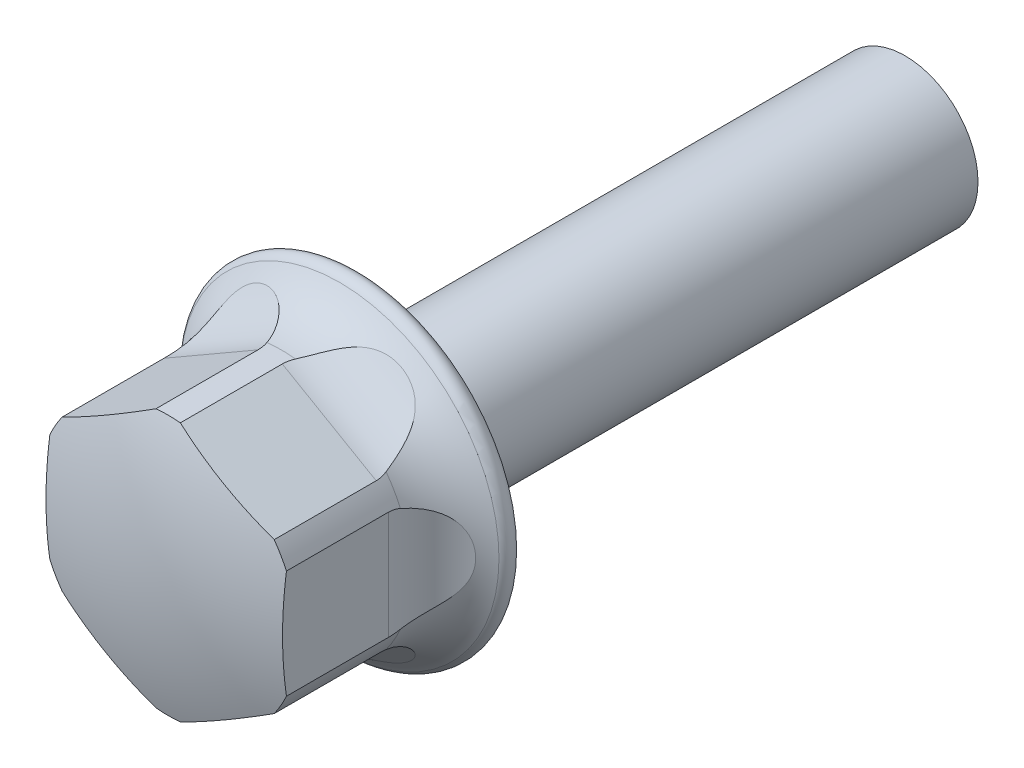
ISO-10303-21;
HEADER;
FILE_DESCRIPTION(('STEP AP214'),'2;1');
FILE_NAME('part.step','',(''),(''),'','','');
FILE_SCHEMA(('AUTOMOTIVE_DESIGN { 1 0 10303 214 1 1 1 1 }'));
ENDSEC;
DATA;
#1=APPLICATION_CONTEXT('core data for automotive mechanical design processes');
#2=APPLICATION_PROTOCOL_DEFINITION('international standard','automotive_design',2000,#1);
#3=PRODUCT_CONTEXT('',#1,'mechanical');
#4=PRODUCT('Part','Part','',(#3));
#5=PRODUCT_RELATED_PRODUCT_CATEGORY('part','',(#4));
#6=PRODUCT_DEFINITION_FORMATION('','',#4);
#7=PRODUCT_DEFINITION_CONTEXT('part definition',#1,'design');
#8=PRODUCT_DEFINITION('design','',#6,#7);
#9=PRODUCT_DEFINITION_SHAPE('','',#8);
#10=(LENGTH_UNIT() NAMED_UNIT(*) SI_UNIT(.MILLI.,.METRE.));
#11=(NAMED_UNIT(*) PLANE_ANGLE_UNIT() SI_UNIT($,.RADIAN.));
#12=(NAMED_UNIT(*) SI_UNIT($,.STERADIAN.) SOLID_ANGLE_UNIT());
#13=UNCERTAINTY_MEASURE_WITH_UNIT(LENGTH_MEASURE(1.E-05),#10,'distance_accuracy_value','');
#14=(GEOMETRIC_REPRESENTATION_CONTEXT(3) GLOBAL_UNCERTAINTY_ASSIGNED_CONTEXT((#13)) GLOBAL_UNIT_ASSIGNED_CONTEXT((#10,
#11,#12)) REPRESENTATION_CONTEXT('',''));
#15=CARTESIAN_POINT('',(0.,0.,0.));
#16=DIRECTION('',(0.,0.,1.));
#17=DIRECTION('',(1.,0.,0.));
#18=AXIS2_PLACEMENT_3D('',#15,#16,#17);
#19=CARTESIAN_POINT('',(0.,0.,0.));
#20=DIRECTION('',(0.,0.,1.));
#21=DIRECTION('',(1.,0.,0.));
#22=AXIS2_PLACEMENT_3D('',#19,#20,#21);
#23=CYLINDRICAL_SURFACE('',#22,7.15);
#24=DIRECTION('',(0.,0.,-1.));
#25=VECTOR('',#24,1.);
#26=CARTESIAN_POINT('',(0.670392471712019,7.1185022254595,11.7));
#27=LINE('',#26,#25);
#28=CARTESIAN_POINT('',(0.670392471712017,7.1185022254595,10.5016762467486));
#29=VERTEX_POINT('',#28);
#30=CARTESIAN_POINT('',(0.670392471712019,7.1185022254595,4.9));
#31=VERTEX_POINT('',#30);
#32=EDGE_CURVE('E306',#29,#31,#27,.T.);
#33=ORIENTED_EDGE('',*,*,#32,.T.);
#34=CARTESIAN_POINT('',(5.82960752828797,4.13982802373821,4.9));
#35=CARTESIAN_POINT('',(5.82960211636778,4.13984064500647,4.99617484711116));
#36=CARTESIAN_POINT('',(5.82476639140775,4.14667190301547,5.09246736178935));
#37=CARTESIAN_POINT('',(5.80553023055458,4.17355648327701,5.28234738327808));
#38=CARTESIAN_POINT('',(5.79110781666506,4.19364018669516,5.37592815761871));
#39=CARTESIAN_POINT('',(5.75316769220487,4.24553649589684,5.55736676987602));
#40=CARTESIAN_POINT('',(5.72968862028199,4.27729924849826,5.64524709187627));
#41=CARTESIAN_POINT('',(5.67424028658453,4.35058609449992,5.81386863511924));
#42=CARTESIAN_POINT('',(5.64227327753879,4.39210759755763,5.89461174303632));
#43=CARTESIAN_POINT('',(5.5670972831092,4.4870837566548,6.05529564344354));
#44=CARTESIAN_POINT('',(5.52310330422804,4.54130162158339,6.13441409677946));
#45=CARTESIAN_POINT('',(5.42674149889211,4.65602944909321,6.28227784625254));
#46=CARTESIAN_POINT('',(5.37436740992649,4.71654410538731,6.35101530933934));
#47=CARTESIAN_POINT('',(5.23381834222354,4.87293573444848,6.51032116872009));
#48=CARTESIAN_POINT('',(5.14092509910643,4.97123117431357,6.5943719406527));
#49=CARTESIAN_POINT('',(4.94114113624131,5.16987038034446,6.74082650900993));
#50=CARTESIAN_POINT('',(4.83421942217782,5.27021825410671,6.80318122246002));
#51=CARTESIAN_POINT('',(4.64973935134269,5.43246313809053,6.88927604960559));
#52=CARTESIAN_POINT('',(4.57550608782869,5.49516978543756,6.91883109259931));
#53=CARTESIAN_POINT('',(4.42293262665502,5.61869995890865,6.97044469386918));
#54=CARTESIAN_POINT('',(4.34459131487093,5.67952296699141,6.99250120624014));
#55=CARTESIAN_POINT('',(4.18434844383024,5.79859476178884,7.0295139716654));
#56=CARTESIAN_POINT('',(4.10244616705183,5.8568430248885,7.04446878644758));
#57=CARTESIAN_POINT('',(3.93555694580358,5.97026591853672,7.0675694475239));
#58=CARTESIAN_POINT('',(3.85056856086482,6.02543908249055,7.07571207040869));
#59=CARTESIAN_POINT('',(3.67706499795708,6.1328804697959,7.08539343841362));
#60=CARTESIAN_POINT('',(3.58852069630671,6.18510850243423,7.08685599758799));
#61=CARTESIAN_POINT('',(3.40941292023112,6.28561421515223,7.08300143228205));
#62=CARTESIAN_POINT('',(3.31885032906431,6.33389358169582,7.07768721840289));
#63=CARTESIAN_POINT('',(3.13626286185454,6.426259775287,7.06017507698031));
#64=CARTESIAN_POINT('',(3.04423811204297,6.47034696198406,7.04797774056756));
#65=CARTESIAN_POINT('',(2.85944107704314,6.55411356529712,7.01645910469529));
#66=CARTESIAN_POINT('',(2.7666689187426,6.59379371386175,6.99713899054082));
#67=CARTESIAN_POINT('',(2.5163643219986,6.6947104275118,6.93490493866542));
#68=CARTESIAN_POINT('',(2.35877045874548,6.75169121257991,6.88493235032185));
#69=CARTESIAN_POINT('',(2.04886790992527,6.8520848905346,6.76087892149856));
#70=CARTESIAN_POINT('',(1.8965521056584,6.89551674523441,6.68683207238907));
#71=CARTESIAN_POINT('',(1.64008295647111,6.96029429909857,6.5330928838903));
#72=CARTESIAN_POINT('',(1.53321305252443,6.98444205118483,6.45913322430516));
#73=CARTESIAN_POINT('',(1.3312306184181,7.02573148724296,6.29493938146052));
#74=CARTESIAN_POINT('',(1.23610235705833,7.04288261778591,6.20472738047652));
#75=CARTESIAN_POINT('',(1.07863661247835,7.06853892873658,6.02607687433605));
#76=CARTESIAN_POINT('',(1.01348065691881,7.07804737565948,5.94027581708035));
#77=CARTESIAN_POINT('',(0.897846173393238,7.09364376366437,5.75893980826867));
#78=CARTESIAN_POINT('',(0.847362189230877,7.09973297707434,5.66340849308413));
#79=CARTESIAN_POINT('',(0.763842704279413,7.10920854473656,5.46407338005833));
#80=CARTESIAN_POINT('',(0.730920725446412,7.11257738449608,5.36022063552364));
#81=CARTESIAN_POINT('',(0.685368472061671,7.11711428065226,5.1480998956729));
#82=CARTESIAN_POINT('',(0.672727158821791,7.118283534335,5.03983433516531));
#83=CARTESIAN_POINT('',(0.668873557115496,7.11864420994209,4.83501332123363));
#84=CARTESIAN_POINT('',(0.675435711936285,7.11804101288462,4.73849376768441));
#85=CARTESIAN_POINT('',(0.704885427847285,7.11518467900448,4.54803038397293));
#86=CARTESIAN_POINT('',(0.727770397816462,7.11293180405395,4.45408614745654));
#87=CARTESIAN_POINT('',(0.788080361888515,7.10649846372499,4.27270193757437));
#88=CARTESIAN_POINT('',(0.825278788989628,7.10234785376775,4.18518473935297));
#89=CARTESIAN_POINT('',(0.912345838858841,7.09168824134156,4.01689711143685));
#90=CARTESIAN_POINT('',(0.962217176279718,7.08517873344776,3.93612813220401));
#91=CARTESIAN_POINT('',(1.07796380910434,7.06853769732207,3.77482528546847));
#92=CARTESIAN_POINT('',(1.14493762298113,7.05811027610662,3.69511407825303));
#93=CARTESIAN_POINT('',(1.28871292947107,7.03328230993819,3.54586442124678));
#94=CARTESIAN_POINT('',(1.3655209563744,7.01887911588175,3.47633280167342));
#95=CARTESIAN_POINT('',(1.56627869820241,6.97741126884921,3.31546538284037));
#96=CARTESIAN_POINT('',(1.69471623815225,6.94760986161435,3.23041808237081));
#97=CARTESIAN_POINT('',(1.96075437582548,6.8772783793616,3.0815549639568));
#98=CARTESIAN_POINT('',(2.09837487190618,6.83672439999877,3.01778717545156));
#99=CARTESIAN_POINT('',(2.32739896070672,6.76126171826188,2.9289485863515));
#100=CARTESIAN_POINT('',(2.41772189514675,6.72952434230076,2.89819544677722));
#101=CARTESIAN_POINT('',(2.59896665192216,6.66162333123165,2.84412740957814));
#102=CARTESIAN_POINT('',(2.68988863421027,6.62545846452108,2.82081458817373));
#103=CARTESIAN_POINT('',(2.87145143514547,6.54881558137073,2.78122250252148));
#104=CARTESIAN_POINT('',(2.96209219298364,6.50833669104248,2.76494466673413));
#105=CARTESIAN_POINT('',(3.14241752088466,6.42321237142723,2.73911377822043));
#106=CARTESIAN_POINT('',(3.23210162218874,6.37856499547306,2.72956388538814));
#107=CARTESIAN_POINT('',(3.41096316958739,6.28475572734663,2.71693789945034));
#108=CARTESIAN_POINT('',(3.50012064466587,6.23554484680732,2.71394330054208));
#109=CARTESIAN_POINT('',(3.67619529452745,6.13338758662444,2.71460764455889));
#110=CARTESIAN_POINT('',(3.76311336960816,6.08044274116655,2.71826386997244));
#111=CARTESIAN_POINT('',(3.93422805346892,5.97115196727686,2.73229823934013));
#112=CARTESIAN_POINT('',(4.01842467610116,5.91480605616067,2.74267634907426));
#113=CARTESIAN_POINT('',(4.18358488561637,5.79916163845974,2.77035982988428));
#114=CARTESIAN_POINT('',(4.26454891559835,5.73986353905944,2.78766424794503));
#115=CARTESIAN_POINT('',(4.41277037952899,5.62650290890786,2.82689552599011));
#116=CARTESIAN_POINT('',(4.48046993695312,5.5727214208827,2.84796587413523));
#117=CARTESIAN_POINT('',(4.61264235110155,5.46382282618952,2.89594527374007));
#118=CARTESIAN_POINT('',(4.67711575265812,5.40870594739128,2.92285333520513));
#119=CARTESIAN_POINT('',(4.80240197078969,5.29777544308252,2.98283389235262));
#120=CARTESIAN_POINT('',(4.86321808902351,5.24196250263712,3.01590071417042));
#121=CARTESIAN_POINT('',(4.98079951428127,5.13037172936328,3.08857321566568));
#122=CARTESIAN_POINT('',(5.03756600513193,5.07459389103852,3.12817697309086));
#123=CARTESIAN_POINT('',(5.17430584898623,4.93586001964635,3.23620146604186));
#124=CARTESIAN_POINT('',(5.25144696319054,4.85346770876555,3.30905020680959));
#125=CARTESIAN_POINT('',(5.39361798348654,4.69496631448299,3.47145127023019));
#126=CARTESIAN_POINT('',(5.45866469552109,4.61884859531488,3.56098006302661));
#127=CARTESIAN_POINT('',(5.56398546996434,4.49111596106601,3.7385577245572));
#128=CARTESIAN_POINT('',(5.60661636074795,4.4375737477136,3.82381115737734));
#129=CARTESIAN_POINT('',(5.68149281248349,4.34129812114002,4.00449170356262));
#130=CARTESIAN_POINT('',(5.71374214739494,4.29856078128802,4.09991510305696));
#131=CARTESIAN_POINT('',(5.7638379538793,4.23110382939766,4.28747356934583));
#132=CARTESIAN_POINT('',(5.782907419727,4.20488539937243,4.37874291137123));
#133=CARTESIAN_POINT('',(5.81158457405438,4.16516569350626,4.56530302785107));
#134=CARTESIAN_POINT('',(5.82121625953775,4.15163216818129,4.66058295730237));
#135=CARTESIAN_POINT('',(5.82841404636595,4.14150782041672,4.80420158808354));
#136=CARTESIAN_POINT('',(5.82961022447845,4.13982173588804,4.85208619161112));
#137=CARTESIAN_POINT('',(5.82960752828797,4.13982802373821,4.9));
#138=B_SPLINE_CURVE_WITH_KNOTS('',3,(#34,#35,#36,#37,#38,#39,#40,#41,#42,#43,#44,#45,#46,#47,
#48,#49,#50,#51,#52,#53,#54,#55,#56,#57,#58,#59,#60,#61,#62,#63,#64,#65,#66,#67,#68,#69,#70,#71,
#72,#73,#74,#75,#76,#77,#78,#79,#80,#81,#82,#83,#84,#85,#86,#87,#88,#89,#90,#91,#92,#93,#94,#95,
#96,#97,#98,#99,#100,#101,#102,#103,#104,#105,#106,#107,#108,#109,#110,#111,#112,#113,#114,#115,
#116,#117,#118,#119,#120,#121,#122,#123,#124,#125,#126,#127,#128,#129,#130,#131,#132,#133,#134,
#135,#136,#137),.UNSPECIFIED.,.T.,.F.,(4,2,2,2,2,2,2,2,2,2,2,2,2,2,2,2,2,2,2,2,2,2,2,2,2,2,2,2,
2,2,2,2,2,2,2,2,2,2,2,2,2,2,2,2,2,2,2,2,2,2,2,4),(0.,0.288374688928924,0.577412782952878,
0.865231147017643,1.15297319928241,1.46835945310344,1.78398250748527,2.25907789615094,
2.73524120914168,3.03959799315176,3.34403775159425,3.64853914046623,3.95318453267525,
4.26129586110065,4.56927490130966,4.87722749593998,5.18512886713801,5.70767059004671,
6.22947769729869,6.62463072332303,7.01924844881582,7.3424018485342,7.66543492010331,
7.99053154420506,8.31545115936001,8.60425778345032,8.8930185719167,9.1773850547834,
9.46181250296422,9.77453409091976,10.0874645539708,10.5555918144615,11.0247686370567,
11.3260849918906,11.6274853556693,11.9289468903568,12.230549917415,12.5358816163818,
12.8410885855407,13.1462940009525,13.451457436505,13.7181920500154,13.9848814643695,
14.2513263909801,14.5176931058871,14.9191569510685,15.3200586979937,15.6467290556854,
15.9732805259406,16.2625967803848,16.5511754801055,16.694842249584),.UNSPECIFIED.);
#139=CARTESIAN_POINT('',(0.78506631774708,7.10676936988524,4.28747881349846));
#140=VERTEX_POINT('',#139);
#141=EDGE_CURVE('E460',#31,#140,#138,.T.);
#142=ORIENTED_EDGE('',*,*,#141,.T.);
#143=CARTESIAN_POINT('',(0.,0.,4.28747881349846));
#144=DIRECTION('',(0.,0.,1.));
#145=DIRECTION('',(1.,0.,0.));
#146=AXIS2_PLACEMENT_3D('',#143,#144,#145);
#147=CIRCLE('',#146,7.15);
#148=CARTESIAN_POINT('',(-0.78506631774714,7.10676936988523,4.28747881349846));
#149=VERTEX_POINT('',#148);
#150=EDGE_CURVE('E357',#149,#140,#147,.F.);
#151=ORIENTED_EDGE('',*,*,#150,.F.);
#152=CARTESIAN_POINT('',(-0.670392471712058,7.1185022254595,4.9));
#153=CARTESIAN_POINT('',(-0.670406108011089,7.11850384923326,4.99617484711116));
#154=CARTESIAN_POINT('',(-0.678740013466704,7.11773161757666,5.09246736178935));
#155=CARTESIAN_POINT('',(-0.711640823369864,7.1145149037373,5.28234738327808));
#156=CARTESIAN_POINT('',(-0.736245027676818,7.11206657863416,5.37592815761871));
#157=CARTESIAN_POINT('',(-0.800158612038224,7.10515762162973,5.55736676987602));
#158=CARTESIAN_POINT('',(-0.839405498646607,7.10070552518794,5.64524709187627));
#159=CARTESIAN_POINT('',(-0.930597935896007,7.08932928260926,5.81386863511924));
#160=CARTESIAN_POINT('',(-0.982540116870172,7.08240579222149,5.89461174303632));
#161=CARTESIAN_POINT('',(-1.102379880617,7.0647895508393,6.05529564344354));
#162=CARTESIAN_POINT('',(-1.17133091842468,7.05379857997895,6.13441409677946));
#163=CARTESIAN_POINT('',(-1.31886903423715,7.02771072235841,6.28227784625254));
#164=CARTESIAN_POINT('',(-1.39746330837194,7.01261075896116,6.35101530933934));
#165=CARTESIAN_POINT('',(-1.60317696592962,6.96908751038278,6.51032116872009));
#166=CARTESIAN_POINT('',(-1.7347499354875,6.93778732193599,6.5943719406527));
#167=CARTESIAN_POINT('',(-2.00666851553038,6.8640889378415,6.74082650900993));
#168=CARTESIAN_POINT('',(-2.147033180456,6.82166595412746,6.80318122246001));
#169=CARTESIAN_POINT('',(-2.3797814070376,6.74302396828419,6.88927604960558));
#170=CARTESIAN_POINT('',(-2.47120358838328,6.71008939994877,6.91883109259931));
#171=CARTESIAN_POINT('',(-2.65447058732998,6.6397219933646,6.97044469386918));
#172=CARTESIAN_POINT('',(-2.74631551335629,6.60228793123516,6.99250120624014));
#173=CARTESIAN_POINT('',(-2.92955614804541,6.52304943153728,7.0295139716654));
#174=CARTESIAN_POINT('',(-3.02095176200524,6.48124411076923,7.04446878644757));
#175=CARTESIAN_POINT('',(-3.20262347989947,6.39342525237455,7.0675694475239));
#176=CARTESIAN_POINT('',(-3.29289903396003,6.34740973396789,7.07571207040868));
#177=CARTESIAN_POINT('',(-3.47269778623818,6.25087193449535,7.08539343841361));
#178=CARTESIAN_POINT('',(-3.56220074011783,6.20030433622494,7.08685599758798));
#179=CARTESIAN_POINT('',(-3.73879512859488,6.09544530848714,7.08300143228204));
#180=CARTESIAN_POINT('',(-3.82588758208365,6.04115548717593,7.07768721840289));
#181=CARTESIAN_POINT('',(-3.99717278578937,5.9292131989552,7.0601750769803));
#182=CARTESIAN_POINT('',(-4.08136578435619,5.87156102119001,7.04797774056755));
#183=CARTESIAN_POINT('',(-4.24630830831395,5.75340539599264,7.01645910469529));
#184=CARTESIAN_POINT('',(-4.32705840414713,5.69290242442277,6.99713899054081));
#185=CARTESIAN_POINT('',(-4.53960714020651,5.52659064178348,6.93490493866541));
#186=CARTESIAN_POINT('',(-4.66775087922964,5.4186007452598,6.88493235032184));
#187=CARTESIAN_POINT('',(-4.90964562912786,5.2004141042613,6.76087892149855));
#188=CARTESIAN_POINT('',(-5.02341662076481,5.09022067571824,6.68683207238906));
#189=CARTESIAN_POINT('',(-5.20775020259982,4.90050065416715,6.53309288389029));
#190=CARTESIAN_POINT('',(-5.28209772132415,4.82002247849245,6.45913322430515));
#191=CARTESIAN_POINT('',(-5.41884663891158,4.66574527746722,6.29493938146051));
#192=CARTESIAN_POINT('',(-5.4812640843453,4.59193735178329,6.20472738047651));
#193=CARTESIAN_POINT('',(-5.58221597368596,4.46839617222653,6.02607687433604));
#194=CARTESIAN_POINT('',(-5.62302850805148,4.41672368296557,5.94027581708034));
#195=CARTESIAN_POINT('',(-5.69435261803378,4.32437947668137,5.75893980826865));
#196=CARTESIAN_POINT('',(-5.72486802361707,4.2837036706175,5.66340849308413));
#197=CARTESIAN_POINT('',(-5.77483384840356,4.21611145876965,5.46407338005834));
#198=CARTESIAN_POINT('',(-5.79421233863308,4.18928460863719,5.36022063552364));
#199=CARTESIAN_POINT('',(-5.82091753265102,4.15210364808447,5.14809989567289));
#200=CARTESIAN_POINT('',(-5.82825079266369,4.14174057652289,5.03983433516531));
#201=CARTESIAN_POINT('',(-5.83048994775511,4.13858359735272,4.83501332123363));
#202=CARTESIAN_POINT('',(-5.82668648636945,4.14396499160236,4.73849376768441));
#203=CARTESIAN_POINT('',(-5.80948797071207,4.16804102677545,4.54803038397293));
#204=CARTESIAN_POINT('',(-5.79609443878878,4.18673355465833,4.45408614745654));
#205=CARTESIAN_POINT('',(-5.76036802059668,4.23574684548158,4.27270193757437));
#206=CARTESIAN_POINT('',(-5.73817427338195,4.26588632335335,4.18518473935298));
#207=CARTESIAN_POINT('',(-5.68540925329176,4.33595879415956,4.01689711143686));
#208=CARTESIAN_POINT('',(-5.65483618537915,4.37589388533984,3.93612813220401));
#209=CARTESIAN_POINT('',(-5.5825513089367,4.46781289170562,3.77482528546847));
#210=CARTESIAN_POINT('',(-5.54003399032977,4.52060020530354,3.69511407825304));
#211=CARTESIAN_POINT('',(-5.44664468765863,4.6326992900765,3.54586442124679));
#212=CARTESIAN_POINT('',(-5.39576714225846,4.69201539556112,3.47633280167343));
#213=CARTESIAN_POINT('',(-5.25947606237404,4.84514277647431,3.31546538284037));
#214=CARTESIAN_POINT('',(-5.16944851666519,4.94147224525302,3.23041808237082));
#215=CARTESIAN_POINT('',(-4.97552059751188,5.13670228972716,3.08155496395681));
#216=CARTESIAN_POINT('',(-4.87158957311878,5.23560814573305,3.01778717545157));
#217=CARTESIAN_POINT('',(-4.69172492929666,5.39621748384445,2.9289485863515));
#218=CARTESIAN_POINT('',(-4.61907808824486,5.45857075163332,2.89819544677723));
#219=CARTESIAN_POINT('',(-4.46965170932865,5.581582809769,2.84412740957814));
#220=CARTESIAN_POINT('',(-4.39287102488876,5.64224112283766,2.82081458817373));
#221=CARTESIAN_POINT('',(-4.23571494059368,5.76115767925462,2.78122250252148));
#222=CARTESIAN_POINT('',(-4.15533881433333,5.81941543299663,2.76494466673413));
#223=CARTESIAN_POINT('',(-3.99145632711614,5.93301958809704,2.73911377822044));
#224=CARTESIAN_POINT('',(-3.90794851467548,5.98836461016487,2.72956388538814));
#225=CARTESIAN_POINT('',(-3.73727653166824,6.09635861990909,2.71693789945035));
#226=CARTESIAN_POINT('',(-3.65007992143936,6.14896581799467,2.71394330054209));
#227=CARTESIAN_POINT('',(-3.47357181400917,6.25037230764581,2.7146076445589));
#228=CARTESIAN_POINT('',(-3.38426119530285,6.2991731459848,2.71826386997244));
#229=CARTESIAN_POINT('',(-3.20405526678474,6.39271742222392,2.73229823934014));
#230=CARTESIAN_POINT('',(-3.11315996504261,6.43746088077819,2.74267634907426));
#231=CARTESIAN_POINT('',(-2.93042885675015,6.52267160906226,2.77035982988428));
#232=CARTESIAN_POINT('',(-2.83859318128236,6.56313946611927,2.78766424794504));
#233=CARTESIAN_POINT('',(-2.66630926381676,6.63482270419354,2.82689552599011));
#234=CARTESIAN_POINT('',(-2.58588335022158,6.66656149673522,2.84796587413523));
#235=CARTESIAN_POINT('',(-2.42548819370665,6.72657686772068,2.89594527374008));
#236=CARTESIAN_POINT('',(-2.34551887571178,6.75485403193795,2.92285333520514));
#237=CARTESIAN_POINT('',(-2.18680713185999,6.80788982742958,2.98283389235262));
#238=CARTESIAN_POINT('',(-2.10806364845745,6.83265166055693,3.01590071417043));
#239=CARTESIAN_POINT('',(-1.95263249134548,6.87868477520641,3.08857321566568));
#240=CARTESIAN_POINT('',(-1.87594422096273,6.89995707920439,3.12817697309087));
#241=CARTESIAN_POINT('',(-1.6874272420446,6.94901032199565,3.23620146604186));
#242=CARTESIAN_POINT('',(-1.57750285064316,6.97462033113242,3.30905020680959));
#243=CARTESIAN_POINT('',(-1.36915110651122,7.01849334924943,3.4714512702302));
#244=CARTESIAN_POINT('',(-1.27070787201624,7.03676659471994,3.56098006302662));
#245=CARTESIAN_POINT('',(-1.10742777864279,7.06411074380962,3.7385577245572));
#246=CARTESIAN_POINT('',(-1.03974341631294,7.07425907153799,3.82381115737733));
#247=CARTESIAN_POINT('',(-0.918928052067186,7.09096616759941,4.00449170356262));
#248=CARTESIAN_POINT('',(-0.865791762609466,7.09752624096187,4.09991510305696));
#249=CARTESIAN_POINT('',(-0.782324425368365,7.10718200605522,4.28747356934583));
#250=CARTESIAN_POINT('',(-0.75008386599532,7.11058743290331,4.37874291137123));
#251=CARTESIAN_POINT('',(-0.701347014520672,7.11556272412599,4.56530302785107));
#252=CARTESIAN_POINT('',(-0.684810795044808,7.11713724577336,4.66058295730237));
#253=CARTESIAN_POINT('',(-0.672443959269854,7.11830853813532,4.80420158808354));
#254=CARTESIAN_POINT('',(-0.670385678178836,7.11850141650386,4.85208619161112));
#255=CARTESIAN_POINT('',(-0.670392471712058,7.1185022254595,4.9));
#256=B_SPLINE_CURVE_WITH_KNOTS('',3,(#152,#153,#154,#155,#156,#157,#158,#159,#160,#161,#162,
#163,#164,#165,#166,#167,#168,#169,#170,#171,#172,#173,#174,#175,#176,#177,#178,#179,#180,#181,
#182,#183,#184,#185,#186,#187,#188,#189,#190,#191,#192,#193,#194,#195,#196,#197,#198,#199,#200,
#201,#202,#203,#204,#205,#206,#207,#208,#209,#210,#211,#212,#213,#214,#215,#216,#217,#218,#219,
#220,#221,#222,#223,#224,#225,#226,#227,#228,#229,#230,#231,#232,#233,#234,#235,#236,#237,#238,
#239,#240,#241,#242,#243,#244,#245,#246,#247,#248,#249,#250,#251,#252,#253,#254,#255),
.UNSPECIFIED.,.T.,.F.,(4,2,2,2,2,2,2,2,2,2,2,2,2,2,2,2,2,2,2,2,2,2,2,2,2,2,2,2,2,2,2,2,2,2,2,2,
2,2,2,2,2,2,2,2,2,2,2,2,2,2,2,4),(0.,0.288374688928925,0.57741278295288,0.865231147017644,
1.15297319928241,1.46835945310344,1.78398250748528,2.25907789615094,2.73524120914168,
3.03959799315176,3.34403775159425,3.64853914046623,3.95318453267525,4.26129586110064,
4.56927490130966,4.87722749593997,5.18512886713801,5.7076705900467,6.22947769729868,
6.62463072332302,7.01924844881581,7.34240184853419,7.66543492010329,7.99053154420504,
8.31545115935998,8.6042577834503,8.89301857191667,9.17738505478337,9.46181250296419,
9.77453409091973,10.0874645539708,10.5555918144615,11.0247686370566,11.3260849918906,
11.6274853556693,11.9289468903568,12.230549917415,12.5358816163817,12.8410885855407,
13.1462940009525,13.451457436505,13.7181920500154,13.9848814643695,14.25132639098,
14.517693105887,14.9191569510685,15.3200586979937,15.6467290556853,15.9732805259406,
16.2625967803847,16.5511754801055,16.6948422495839),.UNSPECIFIED.);
#257=CARTESIAN_POINT('',(-0.670392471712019,7.11850222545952,4.9));
#258=VERTEX_POINT('',#257);
#259=EDGE_CURVE('E311',#149,#258,#256,.T.);
#260=ORIENTED_EDGE('',*,*,#259,.T.);
#261=DIRECTION('',(0.,0.,-1.));
#262=VECTOR('',#261,1.);
#263=CARTESIAN_POINT('',(-0.670392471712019,7.1185022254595,11.7));
#264=LINE('',#263,#262);
#265=CARTESIAN_POINT('',(-0.67039247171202,7.1185022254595,10.5016762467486));
#266=VERTEX_POINT('',#265);
#267=EDGE_CURVE('E309',#266,#258,#264,.T.);
#268=ORIENTED_EDGE('',*,*,#267,.F.);
#269=CARTESIAN_POINT('',(0.,0.,10.5016762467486));
#270=DIRECTION('',(0.,0.,1.));
#271=DIRECTION('',(1.,0.,0.));
#272=AXIS2_PLACEMENT_3D('',#269,#270,#271);
#273=CIRCLE('',#272,7.15);
#274=EDGE_CURVE('E194',#29,#266,#273,.T.);
#275=ORIENTED_EDGE('',*,*,#274,.F.);
#276=EDGE_LOOP('',(#33,#142,#151,#260,#268,#275));
#277=FACE_BOUND('',#276,.T.);
#278=ADVANCED_FACE('F16',(#277),#23,.T.);
#279=DIRECTION('',(0.,0.,-1.));
#280=VECTOR('',#279,1.);
#281=CARTESIAN_POINT('',(-5.82960752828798,4.1398280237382,11.7));
#282=LINE('',#281,#280);
#283=CARTESIAN_POINT('',(-5.82960752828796,4.13982802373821,10.5016762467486));
#284=VERTEX_POINT('',#283);
#285=CARTESIAN_POINT('',(-5.82960752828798,4.1398280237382,4.9));
#286=VERTEX_POINT('',#285);
#287=EDGE_CURVE('E316',#284,#286,#282,.T.);
#288=ORIENTED_EDGE('',*,*,#287,.T.);
#289=CARTESIAN_POINT('',(-5.76210965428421,4.23327205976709,4.28747881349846));
#290=VERTEX_POINT('',#289);
#291=EDGE_CURVE('E649',#286,#290,#256,.T.);
#292=ORIENTED_EDGE('',*,*,#291,.T.);
#293=CARTESIAN_POINT('',(-6.54717597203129,2.87349731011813,4.28747881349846));
#294=VERTEX_POINT('',#293);
#295=EDGE_CURVE('E346',#294,#290,#147,.F.);
#296=ORIENTED_EDGE('',*,*,#295,.F.);
#297=CARTESIAN_POINT('',(-7.15,0.,2.71425070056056));
#298=CARTESIAN_POINT('',(-7.1500021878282,0.0976074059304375,2.71425253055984));
#299=CARTESIAN_POINT('',(-7.14799956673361,0.195190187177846,2.71730889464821));
#300=CARTESIAN_POINT('',(-7.14002999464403,0.389798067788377,2.72959418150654));
#301=CARTESIAN_POINT('',(-7.13406390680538,0.486823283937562,2.73882176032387));
#302=CARTESIAN_POINT('',(-7.11825669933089,0.679948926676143,2.76364141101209));
#303=CARTESIAN_POINT('',(-7.10840742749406,0.776046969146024,2.77924687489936));
#304=CARTESIAN_POINT('',(-7.08503296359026,0.966436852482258,2.81709444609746));
#305=CARTESIAN_POINT('',(-7.07150941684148,1.06072948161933,2.83933358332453));
#306=CARTESIAN_POINT('',(-7.04094946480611,1.24762597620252,2.89105004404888));
#307=CARTESIAN_POINT('',(-7.02388412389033,1.34020862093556,2.92058739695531));
#308=CARTESIAN_POINT('',(-6.98674520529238,1.52200482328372,2.98727981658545));
#309=CARTESIAN_POINT('',(-6.96667103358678,1.61121771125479,3.02443638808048));
#310=CARTESIAN_POINT('',(-6.92418362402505,1.78497971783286,3.10676918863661));
#311=CARTESIAN_POINT('',(-6.90177735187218,1.86954163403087,3.15192180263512));
#312=CARTESIAN_POINT('',(-6.85541078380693,2.03299274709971,3.25077392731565));
#313=CARTESIAN_POINT('',(-6.83145162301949,2.11188600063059,3.30446723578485));
#314=CARTESIAN_POINT('',(-6.7775604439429,2.27959396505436,3.43391584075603));
#315=CARTESIAN_POINT('',(-6.74749436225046,2.36666355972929,3.51191819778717));
#316=CARTESIAN_POINT('',(-6.68905169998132,2.52713148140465,3.68151997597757));
#317=CARTESIAN_POINT('',(-6.66067434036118,2.60053614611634,3.77311305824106));
#318=CARTESIAN_POINT('',(-6.60828884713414,2.73093801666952,3.96993038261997));
#319=CARTESIAN_POINT('',(-6.58432518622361,2.78777126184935,4.07527683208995));
#320=CARTESIAN_POINT('',(-6.54425262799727,2.88060103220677,4.29618793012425));
#321=CARTESIAN_POINT('',(-6.52813504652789,2.91662060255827,4.41174111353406));
#322=CARTESIAN_POINT('',(-6.50776716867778,2.96175259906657,4.63099565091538));
#323=CARTESIAN_POINT('',(-6.50211171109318,2.97406252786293,4.73391418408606));
#324=CARTESIAN_POINT('',(-6.49887467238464,2.98113293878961,4.94046262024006));
#325=CARTESIAN_POINT('',(-6.50128902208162,2.97590226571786,5.04409213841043));
#326=CARTESIAN_POINT('',(-6.51333186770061,2.94943728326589,5.23943354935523));
#327=CARTESIAN_POINT('',(-6.52230414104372,2.9296577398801,5.33138945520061));
#328=CARTESIAN_POINT('',(-6.54584015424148,2.87668402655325,5.51056307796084));
#329=CARTESIAN_POINT('',(-6.56040379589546,2.84349009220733,5.59778087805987));
#330=CARTESIAN_POINT('',(-6.59455477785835,2.76338665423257,5.76917113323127));
#331=CARTESIAN_POINT('',(-6.61432649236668,2.71596232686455,5.85306436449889));
#332=CARTESIAN_POINT('',(-6.65692438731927,2.60981462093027,6.01247117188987));
#333=CARTESIAN_POINT('',(-6.67975217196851,2.55108530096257,6.08798030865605));
#334=CARTESIAN_POINT('',(-6.73651563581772,2.39810603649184,6.25916618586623));
#335=CARTESIAN_POINT('',(-6.771168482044,2.29916456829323,6.35042009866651));
#336=CARTESIAN_POINT('',(-6.83951512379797,2.08709714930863,6.51519621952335));
#337=CARTESIAN_POINT('',(-6.87320679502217,1.97394237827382,6.58868148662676));
#338=CARTESIAN_POINT('',(-6.92577548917,1.77836802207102,6.69642781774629));
#339=CARTESIAN_POINT('',(-6.94575381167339,1.69881081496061,6.73547518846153));
#340=CARTESIAN_POINT('',(-6.98351823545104,1.53621317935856,6.80682440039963));
#341=CARTESIAN_POINT('',(-7.00130366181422,1.45317168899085,6.83912416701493));
#342=CARTESIAN_POINT('',(-7.05067491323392,1.19996971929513,6.92650296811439));
#343=CARTESIAN_POINT('',(-7.07829061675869,1.02567768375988,6.97209013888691));
#344=CARTESIAN_POINT('',(-7.12106388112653,0.667942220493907,7.04112953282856));
#345=CARTESIAN_POINT('',(-7.13597009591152,0.484386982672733,7.06413648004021));
#346=CARTESIAN_POINT('',(-7.15145962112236,0.115072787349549,7.08803541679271));
#347=CARTESIAN_POINT('',(-7.15203403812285,-0.070687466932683,7.08891367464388));
#348=CARTESIAN_POINT('',(-7.14157176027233,-0.363626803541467,7.07277886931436));
#349=CARTESIAN_POINT('',(-7.13525145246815,-0.471446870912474,7.06303436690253));
#350=CARTESIAN_POINT('',(-7.11784924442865,-0.685756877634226,7.03572705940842));
#351=CARTESIAN_POINT('',(-7.10676626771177,-0.792246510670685,7.01816248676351));
#352=CARTESIAN_POINT('',(-7.08010918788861,-1.00290384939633,6.97484764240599));
#353=CARTESIAN_POINT('',(-7.06453845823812,-1.10707323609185,6.94910351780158));
#354=CARTESIAN_POINT('',(-7.02934492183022,-1.31211077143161,6.88891000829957));
#355=CARTESIAN_POINT('',(-7.0097239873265,-1.41298042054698,6.85446464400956));
#356=CARTESIAN_POINT('',(-6.95872664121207,-1.64870018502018,6.76098237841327));
#357=CARTESIAN_POINT('',(-6.92574464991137,-1.78152733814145,6.69759057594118));
#358=CARTESIAN_POINT('',(-6.85569658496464,-2.03447549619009,6.55094671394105));
#359=CARTESIAN_POINT('',(-6.81863752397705,-2.15461764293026,6.46772847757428));
#360=CARTESIAN_POINT('',(-6.75207476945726,-2.35385692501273,6.29978569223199));
#361=CARTESIAN_POINT('',(-6.7226111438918,-2.43628411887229,6.21901267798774));
#362=CARTESIAN_POINT('',(-6.66609488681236,-2.58691713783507,6.04435984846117));
#363=CARTESIAN_POINT('',(-6.63903980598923,-2.65513750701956,5.95049360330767));
#364=CARTESIAN_POINT('',(-6.59387360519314,-2.76520256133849,5.76591009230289));
#365=CARTESIAN_POINT('',(-6.57503009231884,-2.8094653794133,5.67681878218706));
#366=CARTESIAN_POINT('',(-6.54291277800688,-2.88347541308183,5.49182120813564));
#367=CARTESIAN_POINT('',(-6.52963681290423,-2.91322826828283,5.39591760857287));
#368=CARTESIAN_POINT('',(-6.50999900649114,-2.9568567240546,5.19944531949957));
#369=CARTESIAN_POINT('',(-6.50366441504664,-2.97066976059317,5.09885984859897));
#370=CARTESIAN_POINT('',(-6.49872372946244,-2.9814645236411,4.89660015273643));
#371=CARTESIAN_POINT('',(-6.5001162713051,-2.9784492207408,4.79492612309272));
#372=CARTESIAN_POINT('',(-6.5100993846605,-2.95655638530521,4.60085612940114));
#373=CARTESIAN_POINT('',(-6.51818509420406,-2.93879115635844,4.50830506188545));
#374=CARTESIAN_POINT('',(-6.54011517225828,-2.88965582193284,4.32763822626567));
#375=CARTESIAN_POINT('',(-6.5539595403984,-2.85828571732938,4.2395224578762));
#376=CARTESIAN_POINT('',(-6.58672949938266,-2.78195297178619,4.06674379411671));
#377=CARTESIAN_POINT('',(-6.60581198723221,-2.7365640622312,3.98230047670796));
#378=CARTESIAN_POINT('',(-6.64722739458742,-2.63437134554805,3.82155293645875));
#379=CARTESIAN_POINT('',(-6.66956186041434,-2.57756210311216,3.74525261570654));
#380=CARTESIAN_POINT('',(-6.72508197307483,-2.42984858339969,3.57292089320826));
#381=CARTESIAN_POINT('',(-6.75905836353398,-2.33435752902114,3.48106442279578));
#382=CARTESIAN_POINT('',(-6.82648817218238,-2.129152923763,3.31462534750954));
#383=CARTESIAN_POINT('',(-6.85994035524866,-2.01941019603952,3.24007907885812));
#384=CARTESIAN_POINT('',(-6.93326626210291,-1.75401787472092,3.08678490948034));
#385=CARTESIAN_POINT('',(-6.97192421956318,-1.59467060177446,3.01387400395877));
#386=CARTESIAN_POINT('',(-7.0392357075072,-1.26494434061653,2.89304053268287));
#387=CARTESIAN_POINT('',(-7.06788333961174,-1.09455891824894,2.84513269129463));
#388=CARTESIAN_POINT('',(-7.10997674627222,-0.770595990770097,2.77653605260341));
#389=CARTESIAN_POINT('',(-7.12493314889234,-0.617780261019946,2.75308309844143));
#390=CARTESIAN_POINT('',(-7.14494096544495,-0.309955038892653,2.72194227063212));
#391=CARTESIAN_POINT('',(-7.14999652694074,-0.154946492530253,2.71424779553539));
#392=CARTESIAN_POINT('',(-7.15,0.,2.71425070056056));
#393=B_SPLINE_CURVE_WITH_KNOTS('',3,(#297,#298,#299,#300,#301,#302,#303,#304,#305,#306,#307,
#308,#309,#310,#311,#312,#313,#314,#315,#316,#317,#318,#319,#320,#321,#322,#323,#324,#325,#326,
#327,#328,#329,#330,#331,#332,#333,#334,#335,#336,#337,#338,#339,#340,#341,#342,#343,#344,#345,
#346,#347,#348,#349,#350,#351,#352,#353,#354,#355,#356,#357,#358,#359,#360,#361,#362,#363,#364,
#365,#366,#367,#368,#369,#370,#371,#372,#373,#374,#375,#376,#377,#378,#379,#380,#381,#382,#383,
#384,#385,#386,#387,#388,#389,#390,#391,#392),.UNSPECIFIED.,.T.,.F.,(4,2,2,2,2,2,2,2,2,2,2,2,2,
2,2,2,2,2,2,2,2,2,2,2,2,2,2,2,2,2,2,2,2,2,2,2,2,2,2,2,2,2,2,2,2,2,2,4),(0.,0.292710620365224,
0.585357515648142,0.878622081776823,1.17175554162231,1.46738540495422,1.76307371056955,
2.05790288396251,2.3525189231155,2.71323284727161,3.07377905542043,3.43778011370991,
3.80137736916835,4.11106777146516,4.42060203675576,4.70278866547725,4.98497033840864,
5.27893458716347,5.57305375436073,5.98775092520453,6.40330297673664,6.6755091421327,
6.94779887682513,7.49219180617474,8.0471163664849,8.60238527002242,8.92738191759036,
9.25245206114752,9.5772784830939,9.90195508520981,10.3527677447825,10.8028167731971,
11.1587849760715,11.5143869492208,11.8168436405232,12.1191826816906,12.4227044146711,
12.7261725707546,13.0086370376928,13.2911014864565,13.5831792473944,13.8753963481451,
14.2834987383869,14.6924501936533,15.227938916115,15.7637426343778,16.2285997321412,
16.693262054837),.UNSPECIFIED.);
#394=CARTESIAN_POINT('',(-6.5,2.9786742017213,4.9));
#395=VERTEX_POINT('',#394);
#396=EDGE_CURVE('E338',#294,#395,#393,.T.);
#397=ORIENTED_EDGE('',*,*,#396,.T.);
#398=DIRECTION('',(0.,0.,-1.));
#399=VECTOR('',#398,1.);
#400=CARTESIAN_POINT('',(-6.5,2.9786742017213,11.7));
#401=LINE('',#400,#399);
#402=CARTESIAN_POINT('',(-6.5,2.97867420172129,10.5016762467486));
#403=VERTEX_POINT('',#402);
#404=EDGE_CURVE('E330',#403,#395,#401,.T.);
#405=ORIENTED_EDGE('',*,*,#404,.F.);
#406=EDGE_CURVE('E291',#284,#403,#273,.T.);
#407=ORIENTED_EDGE('',*,*,#406,.F.);
#408=EDGE_LOOP('',(#288,#292,#296,#397,#405,#407));
#409=FACE_BOUND('',#408,.T.);
#410=ADVANCED_FACE('F243',(#409),#23,.T.);
#411=CARTESIAN_POINT('',(5.76210965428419,4.23327205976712,4.28747881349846));
#412=VERTEX_POINT('',#411);
#413=CARTESIAN_POINT('',(6.54717597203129,2.87349731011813,4.28747881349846));
#414=VERTEX_POINT('',#413);
#415=EDGE_CURVE('E193',#412,#414,#147,.F.);
#416=ORIENTED_EDGE('',*,*,#415,.F.);
#417=CARTESIAN_POINT('',(5.82960752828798,4.1398280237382,4.9));
#418=VERTEX_POINT('',#417);
#419=EDGE_CURVE('E461',#412,#418,#138,.T.);
#420=ORIENTED_EDGE('',*,*,#419,.T.);
#421=DIRECTION('',(0.,0.,-1.));
#422=VECTOR('',#421,1.);
#423=CARTESIAN_POINT('',(5.82960752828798,4.1398280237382,11.7));
#424=LINE('',#423,#422);
#425=CARTESIAN_POINT('',(5.82960752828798,4.1398280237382,10.5016762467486));
#426=VERTEX_POINT('',#425);
#427=EDGE_CURVE('E636',#426,#418,#424,.T.);
#428=ORIENTED_EDGE('',*,*,#427,.F.);
#429=CARTESIAN_POINT('',(6.5,2.97867420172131,10.5016762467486));
#430=VERTEX_POINT('',#429);
#431=EDGE_CURVE('E189',#430,#426,#273,.T.);
#432=ORIENTED_EDGE('',*,*,#431,.F.);
#433=DIRECTION('',(0.,0.,-1.));
#434=VECTOR('',#433,1.);
#435=CARTESIAN_POINT('',(6.5,2.9786742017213,11.7));
#436=LINE('',#435,#434);
#437=CARTESIAN_POINT('',(6.5,2.9786742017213,4.9));
#438=VERTEX_POINT('',#437);
#439=EDGE_CURVE('E320',#430,#438,#436,.T.);
#440=ORIENTED_EDGE('',*,*,#439,.T.);
#441=CARTESIAN_POINT('',(6.54717597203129,-2.87349731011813,4.28747881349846));
#442=CARTESIAN_POINT('',(6.54027784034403,-2.88921060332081,4.33197927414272));
#443=CARTESIAN_POINT('',(6.5340502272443,-2.90325095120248,4.37715740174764));
#444=CARTESIAN_POINT('',(6.52306080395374,-2.92785970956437,4.46863359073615));
#445=CARTESIAN_POINT('',(6.51829932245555,-2.93842734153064,4.51493190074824));
#446=CARTESIAN_POINT('',(6.50642284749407,-2.96468425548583,4.65491934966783));
#447=CARTESIAN_POINT('',(6.50168460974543,-2.97499727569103,4.7498975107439));
#448=CARTESIAN_POINT('',(6.49906589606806,-2.98071311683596,4.94052326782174));
#449=CARTESIAN_POINT('',(6.50119754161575,-2.97608958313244,5.03617174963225));
#450=CARTESIAN_POINT('',(6.51211544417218,-2.95212137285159,5.22516385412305));
#451=CARTESIAN_POINT('',(6.52089869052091,-2.93278335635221,5.31850849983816));
#452=CARTESIAN_POINT('',(6.54416898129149,-2.88047794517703,5.49974943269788));
#453=CARTESIAN_POINT('',(6.55861367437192,-2.84761166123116,5.58768069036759));
#454=CARTESIAN_POINT('',(6.59193249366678,-2.76960610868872,5.75701169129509));
#455=CARTESIAN_POINT('',(6.61080903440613,-2.72446014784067,5.8384078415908));
#456=CARTESIAN_POINT('',(6.65342705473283,-2.61876583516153,6.00071320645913));
#457=CARTESIAN_POINT('',(6.67745880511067,-2.55716982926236,6.08086030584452));
#458=CARTESIAN_POINT('',(6.72715924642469,-2.42341396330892,6.23114548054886));
#459=CARTESIAN_POINT('',(6.7528287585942,-2.35124877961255,6.30127847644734));
#460=CARTESIAN_POINT('',(6.8166736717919,-2.16096746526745,6.46332933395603));
#461=CARTESIAN_POINT('',(6.85482957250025,-2.03763120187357,6.54914175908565));
#462=CARTESIAN_POINT('',(6.92684301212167,-1.77753603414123,6.69987976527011));
#463=CARTESIAN_POINT('',(6.96069051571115,-1.64074706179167,6.76475710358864));
#464=CARTESIAN_POINT('',(7.0104937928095,-1.40861132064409,6.85575197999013));
#465=CARTESIAN_POINT('',(7.02853203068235,-1.31582279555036,6.88744894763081));
#466=CARTESIAN_POINT('',(7.06120008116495,-1.12742279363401,6.94345637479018));
#467=CARTESIAN_POINT('',(7.0758289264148,-1.03181052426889,6.96776473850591));
#468=CARTESIAN_POINT('',(7.1013227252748,-0.838582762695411,7.00940420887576));
#469=CARTESIAN_POINT('',(7.11218698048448,-0.740966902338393,7.02673402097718));
#470=CARTESIAN_POINT('',(7.12992908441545,-0.544385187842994,7.0547382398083));
#471=CARTESIAN_POINT('',(7.13680506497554,-0.445418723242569,7.0654095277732));
#472=CARTESIAN_POINT('',(7.14649420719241,-0.245496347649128,7.08038514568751));
#473=CARTESIAN_POINT('',(7.14925267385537,-0.144531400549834,7.08460377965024));
#474=CARTESIAN_POINT('',(7.15048214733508,0.0574449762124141,7.08648836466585));
#475=CARTESIAN_POINT('',(7.14895486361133,0.158456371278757,7.08415692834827));
#476=CARTESIAN_POINT('',(7.14164483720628,0.3599644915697,7.07290029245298));
#477=CARTESIAN_POINT('',(7.13586183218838,0.460461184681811,7.0639746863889));
#478=CARTESIAN_POINT('',(7.12015139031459,0.660291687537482,7.03935453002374));
#479=CARTESIAN_POINT('',(7.11022443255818,0.75962563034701,7.02366076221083));
#480=CARTESIAN_POINT('',(7.08768659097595,0.946079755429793,6.98722889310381));
#481=CARTESIAN_POINT('',(7.07546807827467,1.03338520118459,6.96719541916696));
#482=CARTESIAN_POINT('',(7.04810859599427,1.20594102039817,6.92117861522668));
#483=CARTESIAN_POINT('',(7.03296808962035,1.29119171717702,6.89519622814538));
#484=CARTESIAN_POINT('',(7.00009288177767,1.45893551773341,6.83694829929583));
#485=CARTESIAN_POINT('',(6.98236046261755,1.54143096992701,6.80468827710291));
#486=CARTESIAN_POINT('',(6.94473605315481,1.70294610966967,6.73349795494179));
#487=CARTESIAN_POINT('',(6.92484470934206,1.78196682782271,6.69456964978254));
#488=CARTESIAN_POINT('',(6.87301996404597,1.9744271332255,6.58822096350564));
#489=CARTESIAN_POINT('',(6.84006279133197,2.08518252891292,6.51631921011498));
#490=CARTESIAN_POINT('',(6.77317496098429,2.29314568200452,6.35544634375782));
#491=CARTESIAN_POINT('',(6.73924576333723,2.3903725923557,6.2664997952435));
#492=CARTESIAN_POINT('',(6.68014750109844,2.55029364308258,6.08982254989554));
#493=CARTESIAN_POINT('',(6.65453233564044,2.61604272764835,6.00501995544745));
#494=CARTESIAN_POINT('',(6.60729525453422,2.73315618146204,5.82492777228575));
#495=CARTESIAN_POINT('',(6.58567175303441,2.78452626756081,5.72964237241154));
#496=CARTESIAN_POINT('',(6.54858481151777,2.87067531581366,5.5298371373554));
#497=CARTESIAN_POINT('',(6.53316493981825,2.90533726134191,5.42525807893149));
#498=CARTESIAN_POINT('',(6.51063109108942,2.95549758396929,5.21069552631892));
#499=CARTESIAN_POINT('',(6.50351407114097,2.97100298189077,5.10071402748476));
#500=CARTESIAN_POINT('',(6.49882033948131,2.9812490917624,4.89297012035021));
#501=CARTESIAN_POINT('',(6.50019625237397,2.97826921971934,4.79533429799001));
#502=CARTESIAN_POINT('',(6.50993356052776,2.95692431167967,4.60220516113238));
#503=CARTESIAN_POINT('',(6.51828365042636,2.93858417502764,4.50670863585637));
#504=CARTESIAN_POINT('',(6.53227909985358,2.90720944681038,4.39239784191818));
#505=CARTESIAN_POINT('',(6.53505028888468,2.90097710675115,4.37120003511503));
#506=CARTESIAN_POINT('',(6.54089196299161,2.88778219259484,4.32911418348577));
#507=CARTESIAN_POINT('',(6.54396193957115,2.88082085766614,4.30822567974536));
#508=CARTESIAN_POINT('',(6.54717597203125,2.87349731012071,4.28747881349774));
#509=B_SPLINE_CURVE_WITH_KNOTS('',3,(#441,#442,#443,#444,#445,#446,#447,#448,#449,#450,#451,
#452,#453,#454,#455,#456,#457,#458,#459,#460,#461,#462,#463,#464,#465,#466,#467,#468,#469,#470,
#471,#472,#473,#474,#475,#476,#477,#478,#479,#480,#481,#482,#483,#484,#485,#486,#487,#488,#489,
#490,#491,#492,#493,#494,#495,#496,#497,#498,#499,#500,#501,#502,#503,#504,#505,#506,#507,#508),
.UNSPECIFIED.,.F.,.F.,(4,2,2,2,2,2,2,2,2,2,2,2,2,2,2,2,2,2,2,2,2,2,2,2,2,2,2,2,2,2,2,2,2,4),(0.,
0.143009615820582,0.286051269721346,0.571510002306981,0.857472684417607,1.14330601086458,
1.42704071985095,1.71093037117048,2.0214539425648,2.33213446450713,2.79465783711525,
3.25823955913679,3.5569887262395,3.85582255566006,4.15471179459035,4.45374092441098,
4.75670791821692,5.05955408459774,5.36241892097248,5.66524875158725,5.93621072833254,
6.20712978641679,6.47781170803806,6.74841279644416,7.15514982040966,7.56130501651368,
7.89093994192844,8.22044362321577,8.55222263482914,8.88388001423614,9.17552566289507,
9.46669946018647,9.53349619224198,9.60018116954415),.UNSPECIFIED.);
#510=EDGE_CURVE('E372',#438,#414,#509,.T.);
#511=ORIENTED_EDGE('',*,*,#510,.T.);
#512=EDGE_LOOP('',(#416,#420,#428,#432,#440,#511));
#513=FACE_BOUND('',#512,.T.);
#514=ADVANCED_FACE('F250',(#513),#23,.T.);
#515=DIRECTION('',(0.,0.,-1.));
#516=VECTOR('',#515,1.);
#517=CARTESIAN_POINT('',(-0.670392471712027,-7.1185022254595,11.7));
#518=LINE('',#517,#516);
#519=CARTESIAN_POINT('',(-0.670392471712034,-7.1185022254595,10.5016762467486));
#520=VERTEX_POINT('',#519);
#521=CARTESIAN_POINT('',(-0.670392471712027,-7.1185022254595,4.9));
#522=VERTEX_POINT('',#521);
#523=EDGE_CURVE('E40',#520,#522,#518,.T.);
#524=ORIENTED_EDGE('',*,*,#523,.T.);
#525=CARTESIAN_POINT('',(-5.82960752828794,-4.13982802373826,4.9));
#526=CARTESIAN_POINT('',(-5.82960211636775,-4.13984064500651,4.99617484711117));
#527=CARTESIAN_POINT('',(-5.82476639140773,-4.14667190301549,5.09246736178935));
#528=CARTESIAN_POINT('',(-5.80553023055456,-4.17355648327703,5.28234738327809));
#529=CARTESIAN_POINT('',(-5.79110781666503,-4.1936401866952,5.37592815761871));
#530=CARTESIAN_POINT('',(-5.75316769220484,-4.24553649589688,5.55736676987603));
#531=CARTESIAN_POINT('',(-5.72968862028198,-4.27729924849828,5.64524709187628));
#532=CARTESIAN_POINT('',(-5.67424028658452,-4.35058609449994,5.81386863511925));
#533=CARTESIAN_POINT('',(-5.64227327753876,-4.39210759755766,5.89461174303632));
#534=CARTESIAN_POINT('',(-5.56709728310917,-4.48708375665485,6.05529564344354));
#535=CARTESIAN_POINT('',(-5.52310330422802,-4.54130162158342,6.13441409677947));
#536=CARTESIAN_POINT('',(-5.42674149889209,-4.65602944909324,6.28227784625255));
#537=CARTESIAN_POINT('',(-5.37436740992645,-4.71654410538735,6.35101530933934));
#538=CARTESIAN_POINT('',(-5.23381834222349,-4.87293573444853,6.51032116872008));
#539=CARTESIAN_POINT('',(-5.1409250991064,-4.9712311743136,6.59437194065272));
#540=CARTESIAN_POINT('',(-4.94114113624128,-5.16987038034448,6.74082650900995));
#541=CARTESIAN_POINT('',(-4.83421942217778,-5.27021825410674,6.80318122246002));
#542=CARTESIAN_POINT('',(-4.64973935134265,-5.43246313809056,6.88927604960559));
#543=CARTESIAN_POINT('',(-4.57550608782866,-5.49516978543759,6.91883109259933));
#544=CARTESIAN_POINT('',(-4.42293262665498,-5.61869995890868,6.97044469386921));
#545=CARTESIAN_POINT('',(-4.34459131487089,-5.67952296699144,6.99250120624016));
#546=CARTESIAN_POINT('',(-4.1843484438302,-5.79859476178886,7.02951397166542));
#547=CARTESIAN_POINT('',(-4.1024461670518,-5.85684302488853,7.04446878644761));
#548=CARTESIAN_POINT('',(-3.93555694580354,-5.97026591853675,7.06756944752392));
#549=CARTESIAN_POINT('',(-3.85056856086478,-6.02543908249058,7.07571207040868));
#550=CARTESIAN_POINT('',(-3.67706499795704,-6.13288046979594,7.08539343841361));
#551=CARTESIAN_POINT('',(-3.58852069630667,-6.18510850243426,7.086855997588));
#552=CARTESIAN_POINT('',(-3.40941292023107,-6.28561421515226,7.08300143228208));
#553=CARTESIAN_POINT('',(-3.31885032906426,-6.33389358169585,7.07768721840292));
#554=CARTESIAN_POINT('',(-3.13626286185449,-6.42625977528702,7.06017507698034));
#555=CARTESIAN_POINT('',(-3.04423811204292,-6.47034696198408,7.04797774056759));
#556=CARTESIAN_POINT('',(-2.85944107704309,-6.55411356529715,7.01645910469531));
#557=CARTESIAN_POINT('',(-2.76666891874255,-6.59379371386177,6.99713899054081));
#558=CARTESIAN_POINT('',(-2.51636432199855,-6.69471042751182,6.9349049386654));
#559=CARTESIAN_POINT('',(-2.35877045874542,-6.75169121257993,6.88493235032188));
#560=CARTESIAN_POINT('',(-2.04886790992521,-6.85208489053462,6.7608789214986));
#561=CARTESIAN_POINT('',(-1.89655210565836,-6.89551674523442,6.68683207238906));
#562=CARTESIAN_POINT('',(-1.64008295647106,-6.96029429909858,6.5330928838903));
#563=CARTESIAN_POINT('',(-1.53321305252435,-6.98444205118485,6.45913322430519));
#564=CARTESIAN_POINT('',(-1.33123061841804,-7.02573148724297,6.29493938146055));
#565=CARTESIAN_POINT('',(-1.23610235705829,-7.04288261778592,6.20472738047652));
#566=CARTESIAN_POINT('',(-1.07863661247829,-7.06853892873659,6.02607687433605));
#567=CARTESIAN_POINT('',(-1.01348065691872,-7.07804737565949,5.94027581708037));
#568=CARTESIAN_POINT('',(-0.897846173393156,-7.09364376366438,5.75893980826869));
#569=CARTESIAN_POINT('',(-0.847362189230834,-7.09973297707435,5.66340849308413));
#570=CARTESIAN_POINT('',(-0.763842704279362,-7.10920854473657,5.46407338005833));
#571=CARTESIAN_POINT('',(-0.730920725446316,-7.11257738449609,5.36022063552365));
#572=CARTESIAN_POINT('',(-0.685368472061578,-7.11711428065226,5.14809989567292));
#573=CARTESIAN_POINT('',(-0.672727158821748,-7.118283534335,5.03983433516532));
#574=CARTESIAN_POINT('',(-0.668873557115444,-7.11864420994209,4.83501332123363));
#575=CARTESIAN_POINT('',(-0.675435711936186,-7.11804101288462,4.73849376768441));
#576=CARTESIAN_POINT('',(-0.704885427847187,-7.1151846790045,4.54803038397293));
#577=CARTESIAN_POINT('',(-0.727770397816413,-7.11293180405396,4.45408614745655));
#578=CARTESIAN_POINT('',(-0.78808036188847,-7.106498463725,4.27270193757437));
#579=CARTESIAN_POINT('',(-0.825278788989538,-7.10234785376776,4.18518473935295));
#580=CARTESIAN_POINT('',(-0.912345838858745,-7.09168824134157,4.01689711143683));
#581=CARTESIAN_POINT('',(-0.962217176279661,-7.08517873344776,3.93612813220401));
#582=CARTESIAN_POINT('',(-1.07796380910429,-7.06853769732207,3.77482528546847));
#583=CARTESIAN_POINT('',(-1.14493762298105,-7.05811027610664,3.69511407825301));
#584=CARTESIAN_POINT('',(-1.28871292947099,-7.0332823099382,3.54586442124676));
#585=CARTESIAN_POINT('',(-1.36552095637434,-7.01887911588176,3.47633280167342));
#586=CARTESIAN_POINT('',(-1.56627869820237,-6.97741126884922,3.31546538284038));
#587=CARTESIAN_POINT('',(-1.69471623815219,-6.94760986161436,3.23041808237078));
#588=CARTESIAN_POINT('',(-1.96075437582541,-6.87727837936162,3.08155496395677));
#589=CARTESIAN_POINT('',(-2.09837487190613,-6.83672439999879,3.01778717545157));
#590=CARTESIAN_POINT('',(-2.32739896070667,-6.7612617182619,2.9289485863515));
#591=CARTESIAN_POINT('',(-2.4177218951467,-6.72952434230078,2.8981954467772));
#592=CARTESIAN_POINT('',(-2.5989666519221,-6.66162333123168,2.8441274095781));
#593=CARTESIAN_POINT('',(-2.68988863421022,-6.6254584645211,2.8208145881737));
#594=CARTESIAN_POINT('',(-2.87145143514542,-6.54881558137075,2.78122250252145));
#595=CARTESIAN_POINT('',(-2.96209219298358,-6.50833669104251,2.76494466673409));
#596=CARTESIAN_POINT('',(-3.14241752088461,-6.42321237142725,2.73911377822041));
#597=CARTESIAN_POINT('',(-3.2321016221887,-6.37856499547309,2.72956388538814));
#598=CARTESIAN_POINT('',(-3.41096316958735,-6.28475572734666,2.71693789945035));
#599=CARTESIAN_POINT('',(-3.50012064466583,-6.23554484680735,2.71394330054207));
#600=CARTESIAN_POINT('',(-3.67619529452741,-6.13338758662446,2.71460764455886));
#601=CARTESIAN_POINT('',(-3.76311336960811,-6.08044274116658,2.71826386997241));
#602=CARTESIAN_POINT('',(-3.93422805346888,-5.97115196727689,2.73229823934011));
#603=CARTESIAN_POINT('',(-4.01842467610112,-5.9148060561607,2.74267634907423));
#604=CARTESIAN_POINT('',(-4.18358488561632,-5.79916163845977,2.77035982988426));
#605=CARTESIAN_POINT('',(-4.26454891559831,-5.73986353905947,2.78766424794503));
#606=CARTESIAN_POINT('',(-4.41277037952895,-5.62650290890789,2.8268955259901));
#607=CARTESIAN_POINT('',(-4.48046993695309,-5.57272142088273,2.84796587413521));
#608=CARTESIAN_POINT('',(-4.61264235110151,-5.46382282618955,2.89594527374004));
#609=CARTESIAN_POINT('',(-4.67711575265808,-5.40870594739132,2.92285333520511));
#610=CARTESIAN_POINT('',(-4.80240197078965,-5.29777544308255,2.98283389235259));
#611=CARTESIAN_POINT('',(-4.86321808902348,-5.24196250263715,3.01590071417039));
#612=CARTESIAN_POINT('',(-4.98079951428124,-5.13037172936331,3.08857321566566));
#613=CARTESIAN_POINT('',(-5.03756600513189,-5.07459389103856,3.12817697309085));
#614=CARTESIAN_POINT('',(-5.17430584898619,-4.93586001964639,3.23620146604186));
#615=CARTESIAN_POINT('',(-5.25144696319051,-4.85346770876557,3.30905020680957));
#616=CARTESIAN_POINT('',(-5.39361798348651,-4.69496631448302,3.47145127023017));
#617=CARTESIAN_POINT('',(-5.45866469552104,-4.61884859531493,3.56098006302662));
#618=CARTESIAN_POINT('',(-5.56398546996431,-4.49111596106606,3.73855772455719));
#619=CARTESIAN_POINT('',(-5.60661636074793,-4.43757374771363,3.82381115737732));
#620=CARTESIAN_POINT('',(-5.68149281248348,-4.34129812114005,4.0044917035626));
#621=CARTESIAN_POINT('',(-5.71374214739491,-4.29856078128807,4.09991510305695));
#622=CARTESIAN_POINT('',(-5.76383795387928,-4.2311038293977,4.28747356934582));
#623=CARTESIAN_POINT('',(-5.78290741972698,-4.20488539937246,4.37874291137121));
#624=CARTESIAN_POINT('',(-5.81158457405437,-4.16516569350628,4.56530302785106));
#625=CARTESIAN_POINT('',(-5.82121625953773,-4.15163216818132,4.66058295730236));
#626=CARTESIAN_POINT('',(-5.82841404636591,-4.14150782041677,4.80420158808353));
#627=CARTESIAN_POINT('',(-5.82961022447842,-4.13982173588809,4.85208619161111));
#628=CARTESIAN_POINT('',(-5.82960752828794,-4.13982802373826,4.9));
#629=B_SPLINE_CURVE_WITH_KNOTS('',3,(#525,#526,#527,#528,#529,#530,#531,#532,#533,#534,#535,
#536,#537,#538,#539,#540,#541,#542,#543,#544,#545,#546,#547,#548,#549,#550,#551,#552,#553,#554,
#555,#556,#557,#558,#559,#560,#561,#562,#563,#564,#565,#566,#567,#568,#569,#570,#571,#572,#573,
#574,#575,#576,#577,#578,#579,#580,#581,#582,#583,#584,#585,#586,#587,#588,#589,#590,#591,#592,
#593,#594,#595,#596,#597,#598,#599,#600,#601,#602,#603,#604,#605,#606,#607,#608,#609,#610,#611,
#612,#613,#614,#615,#616,#617,#618,#619,#620,#621,#622,#623,#624,#625,#626,#627,#628),
.UNSPECIFIED.,.T.,.F.,(4,2,2,2,2,2,2,2,2,2,2,2,2,2,2,2,2,2,2,2,2,2,2,2,2,2,2,2,2,2,2,2,2,2,2,2,
2,2,2,2,2,2,2,2,2,2,2,2,2,2,2,4),(0.,0.288374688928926,0.577412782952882,0.865231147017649,
1.15297319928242,1.46835945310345,1.78398250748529,2.25907789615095,2.7352412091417,
3.03959799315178,3.34403775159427,3.64853914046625,3.95318453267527,4.26129586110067,
4.56927490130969,4.87722749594,5.18512886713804,5.70767059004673,6.22947769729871,
6.62463072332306,7.01924844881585,7.34240184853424,7.66543492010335,7.9905315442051,
8.31545115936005,8.60425778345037,8.89301857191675,9.17738505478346,9.46181250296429,
9.77453409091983,10.0874645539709,10.5555918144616,11.0247686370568,11.3260849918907,
11.6274853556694,11.9289468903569,12.2305499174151,12.5358816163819,12.8410885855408,
13.1462940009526,13.4514574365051,13.7181920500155,13.9848814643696,14.2513263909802,
14.5176931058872,14.9191569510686,15.3200586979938,15.6467290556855,15.9732805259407,
16.2625967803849,16.5511754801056,16.6948422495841),.UNSPECIFIED.);
#630=CARTESIAN_POINT('',(-0.785066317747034,-7.10676936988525,4.28747881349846));
#631=VERTEX_POINT('',#630);
#632=EDGE_CURVE('E148',#522,#631,#629,.T.);
#633=ORIENTED_EDGE('',*,*,#632,.T.);
#634=CARTESIAN_POINT('',(0.78506631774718,-7.10676936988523,4.28747881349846));
#635=VERTEX_POINT('',#634);
#636=EDGE_CURVE('E200',#635,#631,#147,.F.);
#637=ORIENTED_EDGE('',*,*,#636,.F.);
#638=CARTESIAN_POINT('',(0.670392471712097,-7.11850222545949,4.9));
#639=CARTESIAN_POINT('',(0.670406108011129,-7.11850384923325,4.99617484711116));
#640=CARTESIAN_POINT('',(0.678740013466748,-7.11773161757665,5.09246736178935));
#641=CARTESIAN_POINT('',(0.711640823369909,-7.1145149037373,5.28234738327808));
#642=CARTESIAN_POINT('',(0.736245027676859,-7.11206657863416,5.37592815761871));
#643=CARTESIAN_POINT('',(0.800158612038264,-7.10515762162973,5.55736676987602));
#644=CARTESIAN_POINT('',(0.83940549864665,-7.10070552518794,5.64524709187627));
#645=CARTESIAN_POINT('',(0.930597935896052,-7.08932928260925,5.81386863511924));
#646=CARTESIAN_POINT('',(0.982540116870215,-7.08240579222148,5.89461174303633));
#647=CARTESIAN_POINT('',(1.10237988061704,-7.06478955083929,6.05529564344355));
#648=CARTESIAN_POINT('',(1.17133091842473,-7.05379857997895,6.13441409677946));
#649=CARTESIAN_POINT('',(1.3188690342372,-7.0277107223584,6.28227784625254));
#650=CARTESIAN_POINT('',(1.39746330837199,-7.01261075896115,6.35101530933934));
#651=CARTESIAN_POINT('',(1.60317696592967,-6.96908751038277,6.51032116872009));
#652=CARTESIAN_POINT('',(1.73474993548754,-6.93778732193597,6.5943719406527));
#653=CARTESIAN_POINT('',(2.00666851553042,-6.86408893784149,6.74082650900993));
#654=CARTESIAN_POINT('',(2.14703318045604,-6.82166595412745,6.80318122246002));
#655=CARTESIAN_POINT('',(2.37978140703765,-6.74302396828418,6.88927604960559));
#656=CARTESIAN_POINT('',(2.47120358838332,-6.71008939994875,6.91883109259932));
#657=CARTESIAN_POINT('',(2.65447058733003,-6.63972199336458,6.97044469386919));
#658=CARTESIAN_POINT('',(2.74631551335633,-6.60228793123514,6.99250120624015));
#659=CARTESIAN_POINT('',(2.92955614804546,-6.52304943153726,7.02951397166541));
#660=CARTESIAN_POINT('',(3.02095176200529,-6.48124411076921,7.04446878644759));
#661=CARTESIAN_POINT('',(3.20262347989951,-6.39342525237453,7.06756944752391));
#662=CARTESIAN_POINT('',(3.29289903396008,-6.34740973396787,7.07571207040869));
#663=CARTESIAN_POINT('',(3.47269778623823,-6.25087193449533,7.08539343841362));
#664=CARTESIAN_POINT('',(3.56220074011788,-6.20030433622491,7.08685599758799));
#665=CARTESIAN_POINT('',(3.73879512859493,-6.09544530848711,7.08300143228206));
#666=CARTESIAN_POINT('',(3.8258875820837,-6.0411554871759,7.0776872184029));
#667=CARTESIAN_POINT('',(3.99717278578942,-5.92921319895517,7.06017507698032));
#668=CARTESIAN_POINT('',(4.08136578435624,-5.87156102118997,7.04797774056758));
#669=CARTESIAN_POINT('',(4.246308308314,-5.75340539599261,7.0164591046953));
#670=CARTESIAN_POINT('',(4.32705840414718,-5.69290242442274,6.99713899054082));
#671=CARTESIAN_POINT('',(4.53960714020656,-5.52659064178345,6.93490493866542));
#672=CARTESIAN_POINT('',(4.66775087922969,-5.41860074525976,6.88493235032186));
#673=CARTESIAN_POINT('',(4.90964562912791,-5.20041410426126,6.76087892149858));
#674=CARTESIAN_POINT('',(5.02341662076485,-5.0902206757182,6.68683207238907));
#675=CARTESIAN_POINT('',(5.20775020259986,-4.9005006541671,6.5330928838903));
#676=CARTESIAN_POINT('',(5.2820977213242,-4.82002247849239,6.45913322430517));
#677=CARTESIAN_POINT('',(5.41884663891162,-4.66574527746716,6.29493938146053));
#678=CARTESIAN_POINT('',(5.48126408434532,-4.59193735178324,6.20472738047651));
#679=CARTESIAN_POINT('',(5.582215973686,-4.46839617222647,6.02607687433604));
#680=CARTESIAN_POINT('',(5.62302850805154,-4.4167236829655,5.94027581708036));
#681=CARTESIAN_POINT('',(5.69435261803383,-4.32437947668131,5.75893980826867));
#682=CARTESIAN_POINT('',(5.7248680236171,-4.28370367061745,5.66340849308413));
#683=CARTESIAN_POINT('',(5.77483384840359,-4.2161114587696,5.46407338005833));
#684=CARTESIAN_POINT('',(5.79421233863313,-4.18928460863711,5.36022063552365));
#685=CARTESIAN_POINT('',(5.82091753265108,-4.15210364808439,5.14809989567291));
#686=CARTESIAN_POINT('',(5.82825079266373,-4.14174057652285,5.03983433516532));
#687=CARTESIAN_POINT('',(5.83048994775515,-4.13858359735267,4.83501332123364));
#688=CARTESIAN_POINT('',(5.82668648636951,-4.14396499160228,4.73849376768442));
#689=CARTESIAN_POINT('',(5.80948797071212,-4.16804102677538,4.54803038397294));
#690=CARTESIAN_POINT('',(5.79609443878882,-4.18673355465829,4.45408614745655));
#691=CARTESIAN_POINT('',(5.76036802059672,-4.23574684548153,4.27270193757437));
#692=CARTESIAN_POINT('',(5.738174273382,-4.26588632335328,4.18518473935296));
#693=CARTESIAN_POINT('',(5.68540925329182,-4.33595879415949,4.01689711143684));
#694=CARTESIAN_POINT('',(5.65483618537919,-4.37589388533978,3.93612813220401));
#695=CARTESIAN_POINT('',(5.58255130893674,-4.46781289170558,3.77482528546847));
#696=CARTESIAN_POINT('',(5.54003399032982,-4.52060020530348,3.69511407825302));
#697=CARTESIAN_POINT('',(5.44664468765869,-4.63269929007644,3.54586442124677));
#698=CARTESIAN_POINT('',(5.3957671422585,-4.69201539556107,3.47633280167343));
#699=CARTESIAN_POINT('',(5.25947606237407,-4.84514277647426,3.31546538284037));
#700=CARTESIAN_POINT('',(5.16944851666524,-4.94147224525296,3.2304180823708));
#701=CARTESIAN_POINT('',(4.97552059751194,-5.13670228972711,3.08155496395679));
#702=CARTESIAN_POINT('',(4.87158957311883,-5.235608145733,3.01778717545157));
#703=CARTESIAN_POINT('',(4.69172492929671,-5.39621748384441,2.9289485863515));
#704=CARTESIAN_POINT('',(4.61907808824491,-5.45857075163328,2.89819544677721));
#705=CARTESIAN_POINT('',(4.46965170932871,-5.58158280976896,2.84412740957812));
#706=CARTESIAN_POINT('',(4.39287102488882,-5.64224112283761,2.82081458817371));
#707=CARTESIAN_POINT('',(4.23571494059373,-5.76115767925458,2.78122250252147));
#708=CARTESIAN_POINT('',(4.15533881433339,-5.81941543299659,2.76494466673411));
#709=CARTESIAN_POINT('',(3.9914563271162,-5.933019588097,2.73911377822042));
#710=CARTESIAN_POINT('',(3.90794851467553,-5.98836461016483,2.72956388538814));
#711=CARTESIAN_POINT('',(3.7372765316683,-6.09635861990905,2.71693789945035));
#712=CARTESIAN_POINT('',(3.65007992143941,-6.14896581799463,2.71394330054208));
#713=CARTESIAN_POINT('',(3.47357181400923,-6.25037230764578,2.71460764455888));
#714=CARTESIAN_POINT('',(3.3842611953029,-6.29917314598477,2.71826386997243));
#715=CARTESIAN_POINT('',(3.2040552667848,-6.39271742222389,2.73229823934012));
#716=CARTESIAN_POINT('',(3.11315996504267,-6.43746088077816,2.74267634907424));
#717=CARTESIAN_POINT('',(2.93042885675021,-6.52267160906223,2.77035982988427));
#718=CARTESIAN_POINT('',(2.83859318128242,-6.56313946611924,2.78766424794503));
#719=CARTESIAN_POINT('',(2.66630926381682,-6.63482270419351,2.82689552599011));
#720=CARTESIAN_POINT('',(2.58588335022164,-6.66656149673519,2.84796587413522));
#721=CARTESIAN_POINT('',(2.42548819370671,-6.72657686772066,2.89594527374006));
#722=CARTESIAN_POINT('',(2.34551887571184,-6.75485403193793,2.92285333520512));
#723=CARTESIAN_POINT('',(2.18680713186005,-6.80788982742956,2.98283389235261));
#724=CARTESIAN_POINT('',(2.10806364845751,-6.83265166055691,3.01590071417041));
#725=CARTESIAN_POINT('',(1.95263249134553,-6.87868477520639,3.08857321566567));
#726=CARTESIAN_POINT('',(1.87594422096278,-6.89995707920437,3.12817697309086));
#727=CARTESIAN_POINT('',(1.68742724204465,-6.94901032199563,3.23620146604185));
#728=CARTESIAN_POINT('',(1.57750285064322,-6.9746203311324,3.30905020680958));
#729=CARTESIAN_POINT('',(1.36915110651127,-7.01849334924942,3.47145127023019));
#730=CARTESIAN_POINT('',(1.27070787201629,-7.03676659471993,3.56098006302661));
#731=CARTESIAN_POINT('',(1.10742777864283,-7.06411074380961,3.73855772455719));
#732=CARTESIAN_POINT('',(1.03974341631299,-7.07425907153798,3.82381115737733));
#733=CARTESIAN_POINT('',(0.918928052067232,-7.09096616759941,4.00449170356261));
#734=CARTESIAN_POINT('',(0.865791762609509,-7.09752624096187,4.09991510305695));
#735=CARTESIAN_POINT('',(0.782324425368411,-7.10718200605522,4.28747356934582));
#736=CARTESIAN_POINT('',(0.750083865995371,-7.1105874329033,4.37874291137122));
#737=CARTESIAN_POINT('',(0.701347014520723,-7.11556272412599,4.56530302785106));
#738=CARTESIAN_POINT('',(0.684810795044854,-7.11713724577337,4.66058295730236));
#739=CARTESIAN_POINT('',(0.672443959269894,-7.11830853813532,4.80420158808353));
#740=CARTESIAN_POINT('',(0.670385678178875,-7.11850141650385,4.85208619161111));
#741=CARTESIAN_POINT('',(0.670392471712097,-7.11850222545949,4.9));
#742=B_SPLINE_CURVE_WITH_KNOTS('',3,(#638,#639,#640,#641,#642,#643,#644,#645,#646,#647,#648,
#649,#650,#651,#652,#653,#654,#655,#656,#657,#658,#659,#660,#661,#662,#663,#664,#665,#666,#667,
#668,#669,#670,#671,#672,#673,#674,#675,#676,#677,#678,#679,#680,#681,#682,#683,#684,#685,#686,
#687,#688,#689,#690,#691,#692,#693,#694,#695,#696,#697,#698,#699,#700,#701,#702,#703,#704,#705,
#706,#707,#708,#709,#710,#711,#712,#713,#714,#715,#716,#717,#718,#719,#720,#721,#722,#723,#724,
#725,#726,#727,#728,#729,#730,#731,#732,#733,#734,#735,#736,#737,#738,#739,#740,#741),
.UNSPECIFIED.,.T.,.F.,(4,2,2,2,2,2,2,2,2,2,2,2,2,2,2,2,2,2,2,2,2,2,2,2,2,2,2,2,2,2,2,2,2,2,2,2,
2,2,2,2,2,2,2,2,2,2,2,2,2,2,2,4),(0.,0.288374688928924,0.577412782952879,0.865231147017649,
1.15297319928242,1.46835945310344,1.78398250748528,2.25907789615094,2.73524120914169,
3.03959799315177,3.34403775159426,3.64853914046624,3.95318453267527,4.26129586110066,
4.56927490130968,4.87722749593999,5.18512886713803,5.70767059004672,6.2294776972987,
6.62463072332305,7.01924844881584,7.34240184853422,7.66543492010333,7.99053154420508,
8.31545115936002,8.60425778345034,8.89301857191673,9.17738505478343,9.46181250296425,
9.77453409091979,10.0874645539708,10.5555918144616,11.0247686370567,11.3260849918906,
11.6274853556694,11.9289468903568,12.2305499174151,12.5358816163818,12.8410885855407,
13.1462940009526,13.4514574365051,13.7181920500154,13.9848814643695,14.2513263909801,
14.5176931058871,14.9191569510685,15.3200586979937,15.6467290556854,15.9732805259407,
16.2625967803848,16.5511754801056,16.694842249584),.UNSPECIFIED.);
#743=CARTESIAN_POINT('',(0.670392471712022,-7.11850222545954,4.9));
#744=VERTEX_POINT('',#743);
#745=EDGE_CURVE('E459',#635,#744,#742,.T.);
#746=ORIENTED_EDGE('',*,*,#745,.T.);
#747=DIRECTION('',(0.,0.,-1.));
#748=VECTOR('',#747,1.);
#749=CARTESIAN_POINT('',(0.670392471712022,-7.1185022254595,11.7));
#750=LINE('',#749,#748);
#751=CARTESIAN_POINT('',(0.670392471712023,-7.1185022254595,10.5016762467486));
#752=VERTEX_POINT('',#751);
#753=EDGE_CURVE('E181',#752,#744,#750,.T.);
#754=ORIENTED_EDGE('',*,*,#753,.F.);
#755=EDGE_CURVE('E282',#520,#752,#273,.T.);
#756=ORIENTED_EDGE('',*,*,#755,.F.);
#757=EDGE_LOOP('',(#524,#633,#637,#746,#754,#756));
#758=FACE_BOUND('',#757,.T.);
#759=ADVANCED_FACE('F264',(#758),#23,.T.);
#760=DIRECTION('',(0.,0.,-1.));
#761=VECTOR('',#760,1.);
#762=CARTESIAN_POINT('',(5.82960752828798,-4.1398280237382,11.7));
#763=LINE('',#762,#761);
#764=CARTESIAN_POINT('',(5.82960752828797,-4.13982802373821,10.5016762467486));
#765=VERTEX_POINT('',#764);
#766=CARTESIAN_POINT('',(5.82960752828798,-4.1398280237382,4.9));
#767=VERTEX_POINT('',#766);
#768=EDGE_CURVE('E32',#765,#767,#763,.T.);
#769=ORIENTED_EDGE('',*,*,#768,.T.);
#770=CARTESIAN_POINT('',(5.76210965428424,-4.23327205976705,4.28747881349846));
#771=VERTEX_POINT('',#770);
#772=EDGE_CURVE('E274',#767,#771,#742,.T.);
#773=ORIENTED_EDGE('',*,*,#772,.T.);
#774=CARTESIAN_POINT('',(6.54717597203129,-2.87349731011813,4.28747881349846));
#775=VERTEX_POINT('',#774);
#776=EDGE_CURVE('E195',#775,#771,#147,.F.);
#777=ORIENTED_EDGE('',*,*,#776,.F.);
#778=CARTESIAN_POINT('',(6.5,-2.9786742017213,4.9));
#779=VERTEX_POINT('',#778);
#780=EDGE_CURVE('E374',#775,#779,#509,.T.);
#781=ORIENTED_EDGE('',*,*,#780,.T.);
#782=DIRECTION('',(0.,0.,-1.));
#783=VECTOR('',#782,1.);
#784=CARTESIAN_POINT('',(6.5,-2.9786742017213,11.7));
#785=LINE('',#784,#783);
#786=CARTESIAN_POINT('',(6.5,-2.9786742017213,10.5016762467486));
#787=VERTEX_POINT('',#786);
#788=EDGE_CURVE('E279',#787,#779,#785,.T.);
#789=ORIENTED_EDGE('',*,*,#788,.F.);
#790=EDGE_CURVE('E188',#765,#787,#273,.T.);
#791=ORIENTED_EDGE('',*,*,#790,.F.);
#792=EDGE_LOOP('',(#769,#773,#777,#781,#789,#791));
#793=FACE_BOUND('',#792,.T.);
#794=ADVANCED_FACE('F257',(#793),#23,.T.);
#795=DIRECTION('',(0.,0.,-1.));
#796=VECTOR('',#795,1.);
#797=CARTESIAN_POINT('',(-6.5,-2.9786742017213,11.7));
#798=LINE('',#797,#796);
#799=CARTESIAN_POINT('',(-6.5,-2.97867420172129,10.5016762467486));
#800=VERTEX_POINT('',#799);
#801=CARTESIAN_POINT('',(-6.5,-2.9786742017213,4.9));
#802=VERTEX_POINT('',#801);
#803=EDGE_CURVE('E151',#800,#802,#798,.T.);
#804=ORIENTED_EDGE('',*,*,#803,.T.);
#805=CARTESIAN_POINT('',(-6.54717597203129,-2.87349731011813,4.28747881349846));
#806=VERTEX_POINT('',#805);
#807=EDGE_CURVE('E340',#802,#806,#393,.T.);
#808=ORIENTED_EDGE('',*,*,#807,.T.);
#809=CARTESIAN_POINT('',(-5.76210965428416,-4.23327205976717,4.28747881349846));
#810=VERTEX_POINT('',#809);
#811=EDGE_CURVE('E163',#810,#806,#147,.F.);
#812=ORIENTED_EDGE('',*,*,#811,.F.);
#813=CARTESIAN_POINT('',(-5.82960752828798,-4.13982802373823,4.9));
#814=VERTEX_POINT('',#813);
#815=EDGE_CURVE('E145',#810,#814,#629,.T.);
#816=ORIENTED_EDGE('',*,*,#815,.T.);
#817=DIRECTION('',(0.,0.,-1.));
#818=VECTOR('',#817,1.);
#819=CARTESIAN_POINT('',(-5.82960752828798,-4.1398280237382,11.7));
#820=LINE('',#819,#818);
#821=CARTESIAN_POINT('',(-5.82960752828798,-4.1398280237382,10.5016762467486));
#822=VERTEX_POINT('',#821);
#823=EDGE_CURVE('E152',#822,#814,#820,.T.);
#824=ORIENTED_EDGE('',*,*,#823,.F.);
#825=EDGE_CURVE('E287',#800,#822,#273,.T.);
#826=ORIENTED_EDGE('',*,*,#825,.F.);
#827=EDGE_LOOP('',(#804,#808,#812,#816,#824,#826));
#828=FACE_BOUND('',#827,.T.);
#829=ADVANCED_FACE('F158',(#828),#23,.T.);
#830=CARTESIAN_POINT('',(0.,0.,-10.23));
#831=DIRECTION('',(0.,0.,1.));
#832=DIRECTION('',(-1.,0.,0.));
#833=AXIS2_PLACEMENT_3D('',#830,#831,#832);
#834=SPHERICAL_SURFACE('',#833,21.93);
#835=CARTESIAN_POINT('',(-3.25,-5.62916512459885,-10.23));
#836=DIRECTION('',(-0.5,-0.866025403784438,0.));
#837=DIRECTION('',(0.866025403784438,-0.5,0.));
#838=AXIS2_PLACEMENT_3D('',#835,#836,#837);
#839=CIRCLE('',#838,20.9445673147);
#840=EDGE_CURVE('E168',#520,#822,#839,.T.);
#841=ORIENTED_EDGE('',*,*,#840,.F.);
#842=ORIENTED_EDGE('',*,*,#755,.T.);
#843=CARTESIAN_POINT('',(3.25,-5.62916512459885,-10.23));
#844=DIRECTION('',(0.5,-0.866025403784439,0.));
#845=DIRECTION('',(0.866025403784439,0.5,0.));
#846=AXIS2_PLACEMENT_3D('',#843,#844,#845);
#847=CIRCLE('',#846,20.9445673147);
#848=EDGE_CURVE('E199',#765,#752,#847,.T.);
#849=ORIENTED_EDGE('',*,*,#848,.F.);
#850=ORIENTED_EDGE('',*,*,#790,.T.);
#851=CARTESIAN_POINT('',(6.5,0.,-10.23));
#852=DIRECTION('',(1.,0.,0.));
#853=DIRECTION('',(0.,0.,-1.));
#854=AXIS2_PLACEMENT_3D('',#851,#852,#853);
#855=CIRCLE('',#854,20.9445673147);
#856=EDGE_CURVE('E206',#430,#787,#855,.T.);
#857=ORIENTED_EDGE('',*,*,#856,.F.);
#858=ORIENTED_EDGE('',*,*,#431,.T.);
#859=CARTESIAN_POINT('',(3.25,5.62916512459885,-10.23));
#860=DIRECTION('',(0.5,0.866025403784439,0.));
#861=DIRECTION('',(-0.866025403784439,0.5,0.));
#862=AXIS2_PLACEMENT_3D('',#859,#860,#861);
#863=CIRCLE('',#862,20.9445673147);
#864=EDGE_CURVE('E203',#29,#426,#863,.T.);
#865=ORIENTED_EDGE('',*,*,#864,.F.);
#866=ORIENTED_EDGE('',*,*,#274,.T.);
#867=CARTESIAN_POINT('',(-3.25,5.62916512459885,-10.23));
#868=DIRECTION('',(-0.5,0.866025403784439,0.));
#869=DIRECTION('',(-0.866025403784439,-0.5,0.));
#870=AXIS2_PLACEMENT_3D('',#867,#868,#869);
#871=CIRCLE('',#870,20.9445673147);
#872=EDGE_CURVE('E209',#284,#266,#871,.T.);
#873=ORIENTED_EDGE('',*,*,#872,.F.);
#874=ORIENTED_EDGE('',*,*,#406,.T.);
#875=CARTESIAN_POINT('',(-6.5,0.,-10.23));
#876=DIRECTION('',(-1.,0.,0.));
#877=DIRECTION('',(0.,0.,1.));
#878=AXIS2_PLACEMENT_3D('',#875,#876,#877);
#879=CIRCLE('',#878,20.9445673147);
#880=EDGE_CURVE('E212',#800,#403,#879,.T.);
#881=ORIENTED_EDGE('',*,*,#880,.F.);
#882=ORIENTED_EDGE('',*,*,#825,.T.);
#883=EDGE_LOOP('',(#841,#842,#849,#850,#857,#858,#865,#866,#873,#874,#881,#882));
#884=FACE_BOUND('',#883,.T.);
#885=ADVANCED_FACE('F256',(#884),#834,.T.);
#886=CARTESIAN_POINT('',(0.,0.,4.28747881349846));
#887=DIRECTION('',(0.,0.,-1.));
#888=DIRECTION('',(-1.,0.,0.));
#889=AXIS2_PLACEMENT_3D('',#886,#887,#888);
#890=TOROIDAL_SURFACE('',#889,11.15,4.);
#891=CARTESIAN_POINT('',(0.,0.,1.08097549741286));
#892=DIRECTION('',(0.,0.,1.));
#893=DIRECTION('',(1.,0.,0.));
#894=AXIS2_PLACEMENT_3D('',#891,#892,#893);
#895=CIRCLE('',#894,8.75869565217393);
#896=CARTESIAN_POINT('',(8.75869565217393,0.,1.08097549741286));
#897=VERTEX_POINT('',#896);
#898=EDGE_CURVE('E25',#897,#897,#895,.T.);
#899=ORIENTED_EDGE('',*,*,#898,.T.);
#900=EDGE_LOOP('',(#899));
#901=FACE_BOUND('',#900,.T.);
#902=ORIENTED_EDGE('',*,*,#150,.T.);
#903=CARTESIAN_POINT('',(0.784989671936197,7.10677784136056,4.28767881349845));
#904=CARTESIAN_POINT('',(0.805903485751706,7.10446355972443,4.23310635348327));
#905=CARTESIAN_POINT('',(0.827398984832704,7.10311854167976,4.17872241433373));
#906=CARTESIAN_POINT('',(0.871656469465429,7.10226924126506,4.07045803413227));
#907=CARTESIAN_POINT('',(0.894418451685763,7.10276495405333,4.01657759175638));
#908=CARTESIAN_POINT('',(0.964786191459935,7.10686807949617,3.85581856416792));
#909=CARTESIAN_POINT('',(1.01444969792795,7.11309394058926,3.74988594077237));
#910=CARTESIAN_POINT('',(1.12053476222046,7.13155062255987,3.5408363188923));
#911=CARTESIAN_POINT('',(1.17701167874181,7.14383353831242,3.4377520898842));
#912=CARTESIAN_POINT('',(1.29726985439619,7.17296789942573,3.23665016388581));
#913=CARTESIAN_POINT('',(1.3610472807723,7.18981695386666,3.13862984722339));
#914=CARTESIAN_POINT('',(1.47898406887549,7.22137038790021,2.97389720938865));
#915=CARTESIAN_POINT('',(1.53126937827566,7.23547557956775,2.90572424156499));
#916=CARTESIAN_POINT('',(1.64062750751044,7.26413482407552,2.77344229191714));
#917=CARTESIAN_POINT('',(1.69769907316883,7.27868875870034,2.7093322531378));
#918=CARTESIAN_POINT('',(1.81660790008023,7.30703254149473,2.58606030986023));
#919=CARTESIAN_POINT('',(1.8784222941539,7.32082556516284,2.52687721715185));
#920=CARTESIAN_POINT('',(2.00705368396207,7.34640720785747,2.41378760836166));
#921=CARTESIAN_POINT('',(2.07386915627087,7.3581964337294,2.35987949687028));
#922=CARTESIAN_POINT('',(2.25066926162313,7.38392221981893,2.22973165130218));
#923=CARTESIAN_POINT('',(2.36412150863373,7.39545088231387,2.15759430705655));
#924=CARTESIAN_POINT('',(2.60029936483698,7.40502830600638,2.02923048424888));
#925=CARTESIAN_POINT('',(2.72302344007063,7.40307929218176,1.97300138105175));
#926=CARTESIAN_POINT('',(2.9737868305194,7.38195711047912,1.87674218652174));
#927=CARTESIAN_POINT('',(3.10184298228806,7.3627246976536,1.83676850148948));
#928=CARTESIAN_POINT('',(3.3578018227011,7.30559291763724,1.77250566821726));
#929=CARTESIAN_POINT('',(3.48570433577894,7.26768019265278,1.74822777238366));
#930=CARTESIAN_POINT('',(3.72951896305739,7.17645355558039,1.71518066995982));
#931=CARTESIAN_POINT('',(3.84569953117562,7.12413640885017,1.70560911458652));
#932=CARTESIAN_POINT('',(4.07058406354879,7.00471929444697,1.69882783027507));
#933=CARTESIAN_POINT('',(4.17928772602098,6.93761873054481,1.70161860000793));
#934=CARTESIAN_POINT('',(4.3901164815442,6.78775246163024,1.72006609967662));
#935=CARTESIAN_POINT('',(4.49186414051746,6.70450998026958,1.73618214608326));
#936=CARTESIAN_POINT('',(4.68132917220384,6.52690220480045,1.78279070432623));
#937=CARTESIAN_POINT('',(4.76905594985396,6.43254444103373,1.81327352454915));
#938=CARTESIAN_POINT('',(4.92645586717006,6.23911324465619,1.88873024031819));
#939=CARTESIAN_POINT('',(4.99651472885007,6.14020932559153,1.93333536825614));
#940=CARTESIAN_POINT('',(5.12086754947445,5.94044672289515,2.03752461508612));
#941=CARTESIAN_POINT('',(5.17516283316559,5.83958820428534,2.09710747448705));
#942=CARTESIAN_POINT('',(5.2518222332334,5.67836509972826,2.20510318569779));
#943=CARTESIAN_POINT('',(5.27850262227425,5.61708830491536,2.24924057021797));
#944=CARTESIAN_POINT('',(5.32721616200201,5.4965384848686,2.34256779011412));
#945=CARTESIAN_POINT('',(5.34924815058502,5.43726596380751,2.39175888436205));
#946=CARTESIAN_POINT('',(5.38956148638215,5.32136391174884,2.49482763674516));
#947=CARTESIAN_POINT('',(5.40783430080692,5.26474061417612,2.54871557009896));
#948=CARTESIAN_POINT('',(5.44149863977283,5.1547802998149,2.66059906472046));
#949=CARTESIAN_POINT('',(5.456889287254,5.10144428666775,2.71859586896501));
#950=CARTESIAN_POINT('',(5.49157388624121,4.97733330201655,2.86267706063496));
#951=CARTESIAN_POINT('',(5.50988873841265,4.9083508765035,2.95054530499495));
#952=CARTESIAN_POINT('',(5.54482401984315,4.77812008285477,3.13217521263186));
#953=CARTESIAN_POINT('',(5.56144360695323,4.71687555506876,3.22593976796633));
#954=CARTESIAN_POINT('',(5.59485466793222,4.60232874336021,3.41809673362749));
#955=CARTESIAN_POINT('',(5.61164605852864,4.54902278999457,3.51648697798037));
#956=CARTESIAN_POINT('',(5.64693521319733,4.45030053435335,3.71679147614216));
#957=CARTESIAN_POINT('',(5.66543208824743,4.40488015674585,3.81870387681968));
#958=CARTESIAN_POINT('',(5.69706754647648,4.3390115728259,3.98216960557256));
#959=CARTESIAN_POINT('',(5.70924015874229,4.31602758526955,4.04290221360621));
#960=CARTESIAN_POINT('',(5.73476231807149,4.27268360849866,4.16490456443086));
#961=CARTESIAN_POINT('',(5.74810935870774,4.2523182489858,4.22617292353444));
#962=CARTESIAN_POINT('',(5.76215531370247,4.23320991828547,4.28767881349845));
#963=B_SPLINE_CURVE_WITH_KNOTS('',3,(#903,#904,#905,#906,#907,#908,#909,#910,#911,#912,#913,
#914,#915,#916,#917,#918,#919,#920,#921,#922,#923,#924,#925,#926,#927,#928,#929,#930,#931,#932,
#933,#934,#935,#936,#937,#938,#939,#940,#941,#942,#943,#944,#945,#946,#947,#948,#949,#950,#951,
#952,#953,#954,#955,#956,#957,#958,#959,#960,#961,#962),.UNSPECIFIED.,.F.,.F.,(4,2,2,2,2,2,2,2,
2,2,2,2,2,2,2,2,2,2,2,2,2,2,2,2,2,2,2,2,2,4),(0.,0.175441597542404,0.350882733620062,
0.701968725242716,1.05612839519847,1.41010297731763,1.67109798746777,1.93202481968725,
2.19176434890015,2.4514250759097,2.85444246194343,3.25739331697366,3.66173071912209,
4.06635767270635,4.44800874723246,4.82967521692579,5.2250744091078,5.62020725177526,
6.00577214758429,6.39130463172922,6.63128474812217,6.87132478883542,7.11190381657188,
7.35255593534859,7.6916621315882,8.03093597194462,8.3700524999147,8.7089932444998,
8.90713674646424,9.10486718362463),.UNSPECIFIED.);
#964=EDGE_CURVE('E366',#140,#412,#963,.T.);
#965=ORIENTED_EDGE('',*,*,#964,.T.);
#966=ORIENTED_EDGE('',*,*,#415,.T.);
#967=CARTESIAN_POINT('',(6.54714498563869,2.8735679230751,4.28767881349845));
#968=CARTESIAN_POINT('',(6.55559766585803,2.85429888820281,4.23310635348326));
#969=CARTESIAN_POINT('',(6.5651805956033,2.83501073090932,4.17872241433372));
#970=CARTESIAN_POINT('',(6.58657382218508,2.79625797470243,4.07045803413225));
#971=CARTESIAN_POINT('',(6.59838411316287,2.77679337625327,4.01657759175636));
#972=CARTESIAN_POINT('',(6.63712139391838,2.71790468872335,3.8558185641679));
#973=CARTESIAN_POINT('',(6.66734490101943,2.67800776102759,3.74988594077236));
#974=CARTESIAN_POINT('',(6.7363713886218,2.59536374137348,3.54083631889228));
#975=CARTESIAN_POINT('',(6.77524716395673,2.55259475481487,3.43775208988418));
#976=CARTESIAN_POINT('',(6.86060734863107,2.46301530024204,3.23665016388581));
#977=CARTESIAN_POINT('',(6.90708777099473,2.41620695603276,3.1386298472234));
#978=CARTESIAN_POINT('',(6.99338224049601,2.32984741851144,2.97389720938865));
#979=CARTESIAN_POINT('',(7.03174034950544,2.29161960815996,2.90572424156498));
#980=CARTESIAN_POINT('',(7.11123904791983,2.2112423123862,2.77344229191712));
#981=CARTESIAN_POINT('',(7.15237890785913,2.16909385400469,2.70933225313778));
#982=CARTESIAN_POINT('',(7.23637975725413,2.0802876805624,2.58606030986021));
#983=CARTESIAN_POINT('',(7.27923206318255,2.03365135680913,2.52687721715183));
#984=CARTESIAN_POINT('',(7.36570211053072,1.93504412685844,2.41378760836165));
#985=CARTESIAN_POINT('',(7.40931961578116,1.88307484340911,2.35987949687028));
#986=CARTESIAN_POINT('',(7.51999885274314,1.74282435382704,2.22973165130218));
#987=CARTESIAN_POINT('',(7.58670909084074,1.65033615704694,2.15759430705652));
#988=CARTESIAN_POINT('',(7.71309231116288,1.45058884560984,2.02923048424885));
#989=CARTESIAN_POINT('',(7.77276645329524,1.34333217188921,1.97300138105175));
#990=CARTESIAN_POINT('',(7.87985580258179,1.11560361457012,1.87674218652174));
#991=CARTESIAN_POINT('',(7.92722812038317,0.995087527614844,1.83676850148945));
#992=CARTESIAN_POINT('',(8.0057299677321,0.744854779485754,1.77250566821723));
#993=CARTESIAN_POINT('',(8.03684784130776,0.615131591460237,1.74822777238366));
#994=CARTESIAN_POINT('',(8.07975056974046,0.358368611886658,1.71518066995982));
#995=CARTESIAN_POINT('',(8.09253287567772,0.231594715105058,1.7056091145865));
#996=CARTESIAN_POINT('',(8.10155688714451,-0.0228695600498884,1.69882783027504));
#997=CARTESIAN_POINT('',(8.09779792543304,-0.150559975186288,1.70161860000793));
#998=CARTESIAN_POINT('',(8.07342430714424,-0.408076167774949,1.72006609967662));
#999=CARTESIAN_POINT('',(8.0522080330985,-0.537813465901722,1.73618214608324));
#1000=CARTESIAN_POINT('',(7.99312770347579,-0.790698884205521,1.7827907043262));
#1001=CARTESIAN_POINT('',(7.95527487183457,-0.913851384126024,1.81327352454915));
#1002=CARTESIAN_POINT('',(7.86645850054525,-1.14687930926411,1.88873024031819));
#1003=CARTESIAN_POINT('',(7.81583462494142,-1.25700402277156,1.93333536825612));
#1004=CARTESIAN_POINT('',(7.70501154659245,-1.46457802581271,2.0375246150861));
#1005=CARTESIAN_POINT('',(7.64481314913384,-1.5620283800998,2.09710747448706));
#1006=CARTESIAN_POINT('',(7.54351954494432,-1.70902892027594,2.2051031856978));
#1007=CARTESIAN_POINT('',(7.50379247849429,-1.76277321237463,2.24924057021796));
#1008=CARTESIAN_POINT('',(7.42375004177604,-1.86523528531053,2.34256779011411));
#1009=CARTESIAN_POINT('',(7.38343452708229,-1.91395180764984,2.39175888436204));
#1010=CARTESIAN_POINT('',(7.3032170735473,-2.00681520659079,2.49482763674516));
#1011=CARTESIAN_POINT('',(7.26331626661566,-2.05095157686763,2.54871557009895));
#1012=CARTESIAN_POINT('',(7.18492001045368,-2.13508590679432,2.66059906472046));
#1013=CARTESIAN_POINT('',(7.14642499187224,-2.17508260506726,2.71859586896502));
#1014=CARTESIAN_POINT('',(7.0562840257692,-2.26717584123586,2.86267706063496));
#1015=CARTESIAN_POINT('',(7.00570091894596,-2.31752818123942,2.95054530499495));
#1016=CARTESIAN_POINT('',(6.9103853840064,-2.41289841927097,3.13217521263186));
#1017=CARTESIAN_POINT('',(6.86565586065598,-2.45791366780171,3.22593976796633));
#1018=CARTESIAN_POINT('',(6.78316094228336,-2.54412190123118,3.41809673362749));
#1019=CARTESIAN_POINT('',(6.74539232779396,-2.58531664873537,3.51648697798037));
#1020=CARTESIAN_POINT('',(6.67754092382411,-2.66523908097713,3.71679147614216));
#1021=CARTESIAN_POINT('',(6.64745416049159,-2.70396803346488,3.81870387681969));
#1022=CARTESIAN_POINT('',(6.60622802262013,-2.76429943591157,3.98216960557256));
#1023=CARTESIAN_POINT('',(6.59240961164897,-2.78633322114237,4.04290221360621));
#1024=CARTESIAN_POINT('',(6.56763370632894,-2.83010804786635,4.16490456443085));
#1025=CARTESIAN_POINT('',(6.55667030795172,-2.85184960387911,4.22617292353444));
#1026=CARTESIAN_POINT('',(6.54714498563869,-2.8735679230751,4.28767881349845));
#1027=B_SPLINE_CURVE_WITH_KNOTS('',3,(#967,#968,#969,#970,#971,#972,#973,#974,#975,#976,#977,
#978,#979,#980,#981,#982,#983,#984,#985,#986,#987,#988,#989,#990,#991,#992,#993,#994,#995,#996,
#997,#998,#999,#1000,#1001,#1002,#1003,#1004,#1005,#1006,#1007,#1008,#1009,#1010,#1011,#1012,
#1013,#1014,#1015,#1016,#1017,#1018,#1019,#1020,#1021,#1022,#1023,#1024,#1025,#1026),
.UNSPECIFIED.,.F.,.F.,(4,2,2,2,2,2,2,2,2,2,2,2,2,2,2,2,2,2,2,2,2,2,2,2,2,2,2,2,2,4),(0.,
0.175441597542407,0.350882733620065,0.701968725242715,1.05612839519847,1.41010297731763,
1.67109798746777,1.93202481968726,2.19176434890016,2.45142507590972,2.85444246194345,
3.25739331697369,3.66173071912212,4.06635767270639,4.4480087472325,4.82967521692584,
5.22507440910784,5.6202072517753,6.00577214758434,6.39130463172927,6.63128474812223,
6.87132478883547,7.11190381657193,7.35255593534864,7.69166213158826,8.03093597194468,
8.37005249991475,8.70899324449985,8.90713674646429,9.10486718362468),.UNSPECIFIED.);
#1028=EDGE_CURVE('E174',#414,#775,#1027,.T.);
#1029=ORIENTED_EDGE('',*,*,#1028,.T.);
#1030=ORIENTED_EDGE('',*,*,#776,.T.);
#1031=CARTESIAN_POINT('',(5.76215531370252,-4.23320991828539,4.28767881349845));
#1032=CARTESIAN_POINT('',(5.74969418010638,-4.25016467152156,4.23310635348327));
#1033=CARTESIAN_POINT('',(5.73778161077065,-4.26810781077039,4.17872241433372));
#1034=CARTESIAN_POINT('',(5.71491735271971,-4.30601126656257,4.07045803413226));
#1035=CARTESIAN_POINT('',(5.70396566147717,-4.32597157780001,4.01657759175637));
#1036=CARTESIAN_POINT('',(5.6723352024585,-4.38896339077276,3.8558185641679));
#1037=CARTESIAN_POINT('',(5.65289520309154,-4.43508617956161,3.74988594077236));
#1038=CARTESIAN_POINT('',(5.61583662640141,-4.53618688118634,3.54083631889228));
#1039=CARTESIAN_POINT('',(5.59823548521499,-4.59123878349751,3.43775208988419));
#1040=CARTESIAN_POINT('',(5.56333749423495,-4.70995259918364,3.23665016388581));
#1041=CARTESIAN_POINT('',(5.54604049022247,-4.77360999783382,3.1386298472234));
#1042=CARTESIAN_POINT('',(5.51439817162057,-4.8915229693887,2.97389720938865));
#1043=CARTESIAN_POINT('',(5.50047097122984,-4.94385597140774,2.90572424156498));
#1044=CARTESIAN_POINT('',(5.47061154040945,-5.05289251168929,2.77344229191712));
#1045=CARTESIAN_POINT('',(5.45467983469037,-5.10959490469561,2.70933225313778));
#1046=CARTESIAN_POINT('',(5.41977185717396,-5.22674486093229,2.58606030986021));
#1047=CARTESIAN_POINT('',(5.40080976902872,-5.28717420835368,2.52687721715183));
#1048=CARTESIAN_POINT('',(5.3586484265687,-5.41136308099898,2.41378760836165));
#1049=CARTESIAN_POINT('',(5.33545045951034,-5.47512159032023,2.35987949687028));
#1050=CARTESIAN_POINT('',(5.26932959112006,-5.64109786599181,2.22973165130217));
#1051=CARTESIAN_POINT('',(5.22258758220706,-5.74511472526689,2.15759430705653));
#1052=CARTESIAN_POINT('',(5.11279294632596,-5.9544394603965,2.02923048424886));
#1053=CARTESIAN_POINT('',(5.04974301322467,-6.05974712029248,1.97300138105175));
#1054=CARTESIAN_POINT('',(4.90606897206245,-6.26635349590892,1.87674218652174));
#1055=CARTESIAN_POINT('',(4.82538513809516,-6.3676371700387,1.83676850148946));
#1056=CARTESIAN_POINT('',(4.64792814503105,-6.56073813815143,1.77250566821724));
#1057=CARTESIAN_POINT('',(4.55114350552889,-6.65254860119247,1.74822777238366));
#1058=CARTESIAN_POINT('',(4.35023160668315,-6.81808494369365,1.71518066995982));
#1059=CARTESIAN_POINT('',(4.24683334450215,-6.89254169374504,1.70560911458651));
#1060=CARTESIAN_POINT('',(4.03097282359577,-7.0275888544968,1.69882783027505));
#1061=CARTESIAN_POINT('',(3.91851019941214,-7.08817870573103,1.70161860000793));
#1062=CARTESIAN_POINT('',(3.68330782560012,-7.19582862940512,1.72006609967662));
#1063=CARTESIAN_POINT('',(3.56034389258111,-7.24232344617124,1.73618214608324));
#1064=CARTESIAN_POINT('',(3.311798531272,-7.31760108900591,1.78279070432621));
#1065=CARTESIAN_POINT('',(3.18621892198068,-7.3463958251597,1.81327352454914));
#1066=CARTESIAN_POINT('',(2.94000263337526,-7.38599255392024,1.88873024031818));
#1067=CARTESIAN_POINT('',(2.81931989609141,-7.39721334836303,1.93333536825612));
#1068=CARTESIAN_POINT('',(2.58414399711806,-7.40502474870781,2.03752461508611));
#1069=CARTESIAN_POINT('',(2.46965031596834,-7.40161658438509,2.09710747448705));
#1070=CARTESIAN_POINT('',(2.291697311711,-7.38739402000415,2.20510318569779));
#1071=CARTESIAN_POINT('',(2.22528985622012,-7.37986151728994,2.24924057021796));
#1072=CARTESIAN_POINT('',(2.09653387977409,-7.36177377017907,2.34256779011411));
#1073=CARTESIAN_POINT('',(2.03418637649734,-7.3512177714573,2.39175888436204));
#1074=CARTESIAN_POINT('',(1.91365558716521,-7.32817911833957,2.49482763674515));
#1075=CARTESIAN_POINT('',(1.85548196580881,-7.31569219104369,2.54871557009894));
#1076=CARTESIAN_POINT('',(1.74342137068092,-7.28986620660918,2.66059906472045));
#1077=CARTESIAN_POINT('',(1.68953570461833,-7.27652689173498,2.71859586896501));
#1078=CARTESIAN_POINT('',(1.56471013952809,-7.24450914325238,2.86267706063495));
#1079=CARTESIAN_POINT('',(1.49581218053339,-7.22587905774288,2.95054530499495));
#1080=CARTESIAN_POINT('',(1.36556136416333,-7.1910185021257,3.13217521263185));
#1081=CARTESIAN_POINT('',(1.30421225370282,-7.17478922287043,3.22593976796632));
#1082=CARTESIAN_POINT('',(1.18830627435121,-7.14645064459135,3.41809673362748));
#1083=CARTESIAN_POINT('',(1.1337462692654,-7.13433943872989,3.51648697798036));
#1084=CARTESIAN_POINT('',(1.03060571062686,-7.11553961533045,3.71679147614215));
#1085=CARTESIAN_POINT('',(0.982022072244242,-7.1088481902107,3.81870387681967));
#1086=CARTESIAN_POINT('',(0.909160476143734,-7.10331100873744,3.98216960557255));
#1087=CARTESIAN_POINT('',(0.883169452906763,-7.10236080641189,4.0429022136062));
#1088=CARTESIAN_POINT('',(0.832871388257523,-7.10279165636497,4.16490456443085));
#1089=CARTESIAN_POINT('',(0.808560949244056,-7.10416785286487,4.22617292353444));
#1090=CARTESIAN_POINT('',(0.784989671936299,-7.10677784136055,4.28767881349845));
#1091=B_SPLINE_CURVE_WITH_KNOTS('',3,(#1031,#1032,#1033,#1034,#1035,#1036,#1037,#1038,#1039,
#1040,#1041,#1042,#1043,#1044,#1045,#1046,#1047,#1048,#1049,#1050,#1051,#1052,#1053,#1054,#1055,
#1056,#1057,#1058,#1059,#1060,#1061,#1062,#1063,#1064,#1065,#1066,#1067,#1068,#1069,#1070,#1071,
#1072,#1073,#1074,#1075,#1076,#1077,#1078,#1079,#1080,#1081,#1082,#1083,#1084,#1085,#1086,#1087,
#1088,#1089,#1090),.UNSPECIFIED.,.F.,.F.,(4,2,2,2,2,2,2,2,2,2,2,2,2,2,2,2,2,2,2,2,2,2,2,2,2,2,2,
2,2,4),(0.,0.175441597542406,0.350882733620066,0.701968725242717,1.05612839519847,
1.41010297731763,1.67109798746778,1.93202481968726,2.19176434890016,2.45142507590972,
2.85444246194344,3.25739331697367,3.6617307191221,4.06635767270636,4.44800874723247,
4.82967521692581,5.22507440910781,5.62020725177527,6.00577214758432,6.39130463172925,
6.6312847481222,6.87132478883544,7.1119038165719,7.35255593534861,7.69166213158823,
8.03093597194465,8.37005249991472,8.70899324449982,8.90713674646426,9.10486718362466),.UNSPECIFIED.);
#1092=EDGE_CURVE('E379',#771,#635,#1091,.T.);
#1093=ORIENTED_EDGE('',*,*,#1092,.T.);
#1094=ORIENTED_EDGE('',*,*,#636,.T.);
#1095=CARTESIAN_POINT('',(-0.784989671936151,-7.10677784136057,4.28767881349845));
#1096=CARTESIAN_POINT('',(-0.805903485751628,-7.10446355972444,4.23310635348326));
#1097=CARTESIAN_POINT('',(-0.827398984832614,-7.10311854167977,4.17872241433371));
#1098=CARTESIAN_POINT('',(-0.871656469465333,-7.10226924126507,4.07045803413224));
#1099=CARTESIAN_POINT('',(-0.894418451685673,-7.10276495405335,4.01657759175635));
#1100=CARTESIAN_POINT('',(-0.964786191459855,-7.10686807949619,3.8558185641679));
#1101=CARTESIAN_POINT('',(-1.01444969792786,-7.11309394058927,3.74988594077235));
#1102=CARTESIAN_POINT('',(-1.12053476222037,-7.13155062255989,3.54083631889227));
#1103=CARTESIAN_POINT('',(-1.1770116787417,-7.14383353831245,3.43775208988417));
#1104=CARTESIAN_POINT('',(-1.29726985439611,-7.17296789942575,3.2366501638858));
#1105=CARTESIAN_POINT('',(-1.36104728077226,-7.18981695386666,3.13862984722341));
#1106=CARTESIAN_POINT('',(-1.47898406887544,-7.22137038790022,2.97389720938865));
#1107=CARTESIAN_POINT('',(-1.53126937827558,-7.23547557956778,2.90572424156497));
#1108=CARTESIAN_POINT('',(-1.64062750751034,-7.26413482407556,2.77344229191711));
#1109=CARTESIAN_POINT('',(-1.69769907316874,-7.27868875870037,2.70933225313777));
#1110=CARTESIAN_POINT('',(-1.81660790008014,-7.30703254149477,2.5860603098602));
#1111=CARTESIAN_POINT('',(-1.8784222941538,-7.32082556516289,2.52687721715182));
#1112=CARTESIAN_POINT('',(-2.00705368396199,-7.3464072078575,2.41378760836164));
#1113=CARTESIAN_POINT('',(-2.07386915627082,-7.35819643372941,2.35987949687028));
#1114=CARTESIAN_POINT('',(-2.25066926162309,-7.38392221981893,2.22973165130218));
#1115=CARTESIAN_POINT('',(-2.36412150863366,-7.39545088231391,2.15759430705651));
#1116=CARTESIAN_POINT('',(-2.6002993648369,-7.40502830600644,2.02923048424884));
#1117=CARTESIAN_POINT('',(-2.72302344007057,-7.40307929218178,1.97300138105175));
#1118=CARTESIAN_POINT('',(-2.97378683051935,-7.38195711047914,1.87674218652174));
#1119=CARTESIAN_POINT('',(-3.10184298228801,-7.36272469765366,1.83676850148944));
#1120=CARTESIAN_POINT('',(-3.35780182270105,-7.30559291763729,1.77250566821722));
#1121=CARTESIAN_POINT('',(-3.48570433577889,-7.2676801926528,1.74822777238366));
#1122=CARTESIAN_POINT('',(-3.72951896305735,-7.17645355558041,1.71518066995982));
#1123=CARTESIAN_POINT('',(-3.84569953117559,-7.12413640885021,1.70560911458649));
#1124=CARTESIAN_POINT('',(-4.07058406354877,-7.00471929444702,1.69882783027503));
#1125=CARTESIAN_POINT('',(-4.17928772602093,-6.93761873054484,1.70161860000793));
#1126=CARTESIAN_POINT('',(-4.39011648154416,-6.78775246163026,1.72006609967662));
#1127=CARTESIAN_POINT('',(-4.49186414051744,-6.70450998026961,1.73618214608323));
#1128=CARTESIAN_POINT('',(-4.68132917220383,-6.52690220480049,1.7827907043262));
#1129=CARTESIAN_POINT('',(-4.76905594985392,-6.43254444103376,1.81327352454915));
#1130=CARTESIAN_POINT('',(-4.92645586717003,-6.23911324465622,1.88873024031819));
#1131=CARTESIAN_POINT('',(-4.99651472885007,-6.14020932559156,1.93333536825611));
#1132=CARTESIAN_POINT('',(-5.12086754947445,-5.94044672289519,2.03752461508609));
#1133=CARTESIAN_POINT('',(-5.17516283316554,-5.83958820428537,2.09710747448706));
#1134=CARTESIAN_POINT('',(-5.25182223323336,-5.67836509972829,2.2051031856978));
#1135=CARTESIAN_POINT('',(-5.27850262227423,-5.61708830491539,2.24924057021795));
#1136=CARTESIAN_POINT('',(-5.32721616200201,-5.49653848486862,2.3425677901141));
#1137=CARTESIAN_POINT('',(-5.34924815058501,-5.43726596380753,2.39175888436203));
#1138=CARTESIAN_POINT('',(-5.38956148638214,-5.32136391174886,2.49482763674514));
#1139=CARTESIAN_POINT('',(-5.40783430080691,-5.26474061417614,2.54871557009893));
#1140=CARTESIAN_POINT('',(-5.44149863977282,-5.15478029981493,2.66059906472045));
#1141=CARTESIAN_POINT('',(-5.45688928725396,-5.10144428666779,2.71859586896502));
#1142=CARTESIAN_POINT('',(-5.49157388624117,-4.97733330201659,2.86267706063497));
#1143=CARTESIAN_POINT('',(-5.50988873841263,-4.90835087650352,2.95054530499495));
#1144=CARTESIAN_POINT('',(-5.54482401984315,-4.77812008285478,3.13217521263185));
#1145=CARTESIAN_POINT('',(-5.56144360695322,-4.71687555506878,3.22593976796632));
#1146=CARTESIAN_POINT('',(-5.59485466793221,-4.60232874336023,3.41809673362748));
#1147=CARTESIAN_POINT('',(-5.61164605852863,-4.54902278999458,3.51648697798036));
#1148=CARTESIAN_POINT('',(-5.64693521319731,-4.45030053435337,3.71679147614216));
#1149=CARTESIAN_POINT('',(-5.66543208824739,-4.40488015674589,3.81870387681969));
#1150=CARTESIAN_POINT('',(-5.69706754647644,-4.33901157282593,3.98216960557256));
#1151=CARTESIAN_POINT('',(-5.70924015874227,-4.31602758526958,4.04290221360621));
#1152=CARTESIAN_POINT('',(-5.73476231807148,-4.27268360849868,4.16490456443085));
#1153=CARTESIAN_POINT('',(-5.74810935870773,-4.25231824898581,4.22617292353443));
#1154=CARTESIAN_POINT('',(-5.76215531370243,-4.23320991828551,4.28767881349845));
#1155=B_SPLINE_CURVE_WITH_KNOTS('',3,(#1095,#1096,#1097,#1098,#1099,#1100,#1101,#1102,#1103,
#1104,#1105,#1106,#1107,#1108,#1109,#1110,#1111,#1112,#1113,#1114,#1115,#1116,#1117,#1118,#1119,
#1120,#1121,#1122,#1123,#1124,#1125,#1126,#1127,#1128,#1129,#1130,#1131,#1132,#1133,#1134,#1135,
#1136,#1137,#1138,#1139,#1140,#1141,#1142,#1143,#1144,#1145,#1146,#1147,#1148,#1149,#1150,#1151,
#1152,#1153,#1154),.UNSPECIFIED.,.F.,.F.,(4,2,2,2,2,2,2,2,2,2,2,2,2,2,2,2,2,2,2,2,2,2,2,2,2,2,2,
2,2,4),(0.,0.175441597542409,0.35088273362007,0.701968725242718,1.05612839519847,
1.41010297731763,1.67109798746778,1.93202481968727,2.19176434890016,2.45142507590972,
2.85444246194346,3.25739331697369,3.66173071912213,4.06635767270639,4.44800874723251,
4.82967521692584,5.22507440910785,5.62020725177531,6.00577214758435,6.39130463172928,
6.63128474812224,6.87132478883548,7.11190381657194,7.35255593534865,7.69166213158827,
8.03093597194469,8.37005249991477,8.70899324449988,8.90713674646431,9.10486718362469),.UNSPECIFIED.);
#1156=EDGE_CURVE('E352',#631,#810,#1155,.T.);
#1157=ORIENTED_EDGE('',*,*,#1156,.T.);
#1158=ORIENTED_EDGE('',*,*,#811,.T.);
#1159=CARTESIAN_POINT('',(-6.54714498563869,-2.8735679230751,4.28767881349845));
#1160=CARTESIAN_POINT('',(-6.55559766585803,-2.85429888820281,4.23310635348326));
#1161=CARTESIAN_POINT('',(-6.5651805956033,-2.83501073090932,4.17872241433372));
#1162=CARTESIAN_POINT('',(-6.58657382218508,-2.79625797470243,4.07045803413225));
#1163=CARTESIAN_POINT('',(-6.59838411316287,-2.77679337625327,4.01657759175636));
#1164=CARTESIAN_POINT('',(-6.63712139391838,-2.71790468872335,3.8558185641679));
#1165=CARTESIAN_POINT('',(-6.66734490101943,-2.67800776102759,3.74988594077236));
#1166=CARTESIAN_POINT('',(-6.7363713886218,-2.59536374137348,3.54083631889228));
#1167=CARTESIAN_POINT('',(-6.77524716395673,-2.55259475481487,3.43775208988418));
#1168=CARTESIAN_POINT('',(-6.86060734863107,-2.46301530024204,3.23665016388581));
#1169=CARTESIAN_POINT('',(-6.90708777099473,-2.41620695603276,3.1386298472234));
#1170=CARTESIAN_POINT('',(-6.99338224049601,-2.32984741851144,2.97389720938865));
#1171=CARTESIAN_POINT('',(-7.03174034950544,-2.29161960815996,2.90572424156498));
#1172=CARTESIAN_POINT('',(-7.11123904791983,-2.2112423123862,2.77344229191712));
#1173=CARTESIAN_POINT('',(-7.15237890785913,-2.16909385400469,2.70933225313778));
#1174=CARTESIAN_POINT('',(-7.23637975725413,-2.0802876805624,2.58606030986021));
#1175=CARTESIAN_POINT('',(-7.27923206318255,-2.03365135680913,2.52687721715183));
#1176=CARTESIAN_POINT('',(-7.36570211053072,-1.93504412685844,2.41378760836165));
#1177=CARTESIAN_POINT('',(-7.40931961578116,-1.88307484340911,2.35987949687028));
#1178=CARTESIAN_POINT('',(-7.51999885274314,-1.74282435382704,2.22973165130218));
#1179=CARTESIAN_POINT('',(-7.58670909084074,-1.65033615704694,2.15759430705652));
#1180=CARTESIAN_POINT('',(-7.71309231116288,-1.45058884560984,2.02923048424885));
#1181=CARTESIAN_POINT('',(-7.77276645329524,-1.34333217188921,1.97300138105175));
#1182=CARTESIAN_POINT('',(-7.87985580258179,-1.11560361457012,1.87674218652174));
#1183=CARTESIAN_POINT('',(-7.92722812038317,-0.995087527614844,1.83676850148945));
#1184=CARTESIAN_POINT('',(-8.0057299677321,-0.744854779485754,1.77250566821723));
#1185=CARTESIAN_POINT('',(-8.03684784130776,-0.615131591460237,1.74822777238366));
#1186=CARTESIAN_POINT('',(-8.07975056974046,-0.358368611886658,1.71518066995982));
#1187=CARTESIAN_POINT('',(-8.09253287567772,-0.231594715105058,1.7056091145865));
#1188=CARTESIAN_POINT('',(-8.10155688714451,0.0228695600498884,1.69882783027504));
#1189=CARTESIAN_POINT('',(-8.09779792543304,0.150559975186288,1.70161860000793));
#1190=CARTESIAN_POINT('',(-8.07342430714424,0.408076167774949,1.72006609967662));
#1191=CARTESIAN_POINT('',(-8.0522080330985,0.537813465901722,1.73618214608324));
#1192=CARTESIAN_POINT('',(-7.99312770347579,0.790698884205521,1.7827907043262));
#1193=CARTESIAN_POINT('',(-7.95527487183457,0.913851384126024,1.81327352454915));
#1194=CARTESIAN_POINT('',(-7.86645850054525,1.14687930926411,1.88873024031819));
#1195=CARTESIAN_POINT('',(-7.81583462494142,1.25700402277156,1.93333536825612));
#1196=CARTESIAN_POINT('',(-7.70501154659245,1.46457802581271,2.0375246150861));
#1197=CARTESIAN_POINT('',(-7.64481314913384,1.5620283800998,2.09710747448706));
#1198=CARTESIAN_POINT('',(-7.54351954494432,1.70902892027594,2.2051031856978));
#1199=CARTESIAN_POINT('',(-7.50379247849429,1.76277321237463,2.24924057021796));
#1200=CARTESIAN_POINT('',(-7.42375004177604,1.86523528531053,2.34256779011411));
#1201=CARTESIAN_POINT('',(-7.38343452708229,1.91395180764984,2.39175888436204));
#1202=CARTESIAN_POINT('',(-7.3032170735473,2.00681520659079,2.49482763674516));
#1203=CARTESIAN_POINT('',(-7.26331626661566,2.05095157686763,2.54871557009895));
#1204=CARTESIAN_POINT('',(-7.18492001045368,2.13508590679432,2.66059906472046));
#1205=CARTESIAN_POINT('',(-7.14642499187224,2.17508260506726,2.71859586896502));
#1206=CARTESIAN_POINT('',(-7.0562840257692,2.26717584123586,2.86267706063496));
#1207=CARTESIAN_POINT('',(-7.00570091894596,2.31752818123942,2.95054530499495));
#1208=CARTESIAN_POINT('',(-6.9103853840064,2.41289841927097,3.13217521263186));
#1209=CARTESIAN_POINT('',(-6.86565586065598,2.45791366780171,3.22593976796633));
#1210=CARTESIAN_POINT('',(-6.78316094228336,2.54412190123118,3.41809673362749));
#1211=CARTESIAN_POINT('',(-6.74539232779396,2.58531664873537,3.51648697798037));
#1212=CARTESIAN_POINT('',(-6.67754092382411,2.66523908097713,3.71679147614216));
#1213=CARTESIAN_POINT('',(-6.64745416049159,2.70396803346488,3.81870387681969));
#1214=CARTESIAN_POINT('',(-6.60622802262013,2.76429943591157,3.98216960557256));
#1215=CARTESIAN_POINT('',(-6.59240961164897,2.78633322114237,4.04290221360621));
#1216=CARTESIAN_POINT('',(-6.56763370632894,2.83010804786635,4.16490456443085));
#1217=CARTESIAN_POINT('',(-6.55667030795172,2.85184960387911,4.22617292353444));
#1218=CARTESIAN_POINT('',(-6.54714498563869,2.8735679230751,4.28767881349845));
#1219=B_SPLINE_CURVE_WITH_KNOTS('',3,(#1159,#1160,#1161,#1162,#1163,#1164,#1165,#1166,#1167,
#1168,#1169,#1170,#1171,#1172,#1173,#1174,#1175,#1176,#1177,#1178,#1179,#1180,#1181,#1182,#1183,
#1184,#1185,#1186,#1187,#1188,#1189,#1190,#1191,#1192,#1193,#1194,#1195,#1196,#1197,#1198,#1199,
#1200,#1201,#1202,#1203,#1204,#1205,#1206,#1207,#1208,#1209,#1210,#1211,#1212,#1213,#1214,#1215,
#1216,#1217,#1218),.UNSPECIFIED.,.F.,.F.,(4,2,2,2,2,2,2,2,2,2,2,2,2,2,2,2,2,2,2,2,2,2,2,2,2,2,2,
2,2,4),(0.,0.175441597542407,0.350882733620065,0.701968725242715,1.05612839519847,
1.41010297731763,1.67109798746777,1.93202481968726,2.19176434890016,2.45142507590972,
2.85444246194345,3.25739331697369,3.66173071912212,4.06635767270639,4.4480087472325,
4.82967521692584,5.22507440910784,5.6202072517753,6.00577214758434,6.39130463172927,
6.63128474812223,6.87132478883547,7.11190381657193,7.35255593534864,7.69166213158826,
8.03093597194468,8.37005249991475,8.70899324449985,8.90713674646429,9.10486718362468),.UNSPECIFIED.);
#1220=EDGE_CURVE('E348',#806,#294,#1219,.T.);
#1221=ORIENTED_EDGE('',*,*,#1220,.T.);
#1222=ORIENTED_EDGE('',*,*,#295,.T.);
#1223=CARTESIAN_POINT('',(-5.76215531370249,4.23320991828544,4.28767881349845));
#1224=CARTESIAN_POINT('',(-5.74969418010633,4.25016467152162,4.23310635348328));
#1225=CARTESIAN_POINT('',(-5.7377816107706,4.26810781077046,4.17872241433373));
#1226=CARTESIAN_POINT('',(-5.71491735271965,4.30601126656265,4.07045803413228));
#1227=CARTESIAN_POINT('',(-5.70396566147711,4.32597157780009,4.01657759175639));
#1228=CARTESIAN_POINT('',(-5.67233520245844,4.38896339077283,3.85581856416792));
#1229=CARTESIAN_POINT('',(-5.65289520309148,4.43508617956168,3.74988594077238));
#1230=CARTESIAN_POINT('',(-5.61583662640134,4.53618688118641,3.5408363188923));
#1231=CARTESIAN_POINT('',(-5.59823548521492,4.59123878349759,3.43775208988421));
#1232=CARTESIAN_POINT('',(-5.56333749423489,4.7099525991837,3.23665016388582));
#1233=CARTESIAN_POINT('',(-5.54604049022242,4.77360999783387,3.1386298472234));
#1234=CARTESIAN_POINT('',(-5.51439817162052,4.89152296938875,2.97389720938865));
#1235=CARTESIAN_POINT('',(-5.50047097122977,4.9438559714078,2.905724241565));
#1236=CARTESIAN_POINT('',(-5.47061154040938,5.05289251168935,2.77344229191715));
#1237=CARTESIAN_POINT('',(-5.4546798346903,5.10959490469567,2.70933225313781));
#1238=CARTESIAN_POINT('',(-5.41977185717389,5.22674486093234,2.58606030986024));
#1239=CARTESIAN_POINT('',(-5.40080976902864,5.28717420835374,2.52687721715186));
#1240=CARTESIAN_POINT('',(-5.35864842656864,5.41136308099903,2.41378760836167));
#1241=CARTESIAN_POINT('',(-5.33545045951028,5.47512159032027,2.35987949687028));
#1242=CARTESIAN_POINT('',(-5.26932959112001,5.64109786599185,2.22973165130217));
#1243=CARTESIAN_POINT('',(-5.22258758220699,5.74511472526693,2.15759430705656));
#1244=CARTESIAN_POINT('',(-5.11279294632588,5.95443946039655,2.02923048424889));
#1245=CARTESIAN_POINT('',(-5.04974301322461,6.05974712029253,1.97300138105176));
#1246=CARTESIAN_POINT('',(-4.90606897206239,6.26635349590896,1.87674218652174));
#1247=CARTESIAN_POINT('',(-4.82538513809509,6.36763717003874,1.83676850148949));
#1248=CARTESIAN_POINT('',(-4.64792814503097,6.56073813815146,1.77250566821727));
#1249=CARTESIAN_POINT('',(-4.55114350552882,6.65254860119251,1.74822777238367));
#1250=CARTESIAN_POINT('',(-4.35023160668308,6.81808494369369,1.71518066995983));
#1251=CARTESIAN_POINT('',(-4.24683334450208,6.89254169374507,1.70560911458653));
#1252=CARTESIAN_POINT('',(-4.03097282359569,7.02758885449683,1.69882783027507));
#1253=CARTESIAN_POINT('',(-3.91851019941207,7.08817870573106,1.70161860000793));
#1254=CARTESIAN_POINT('',(-3.68330782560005,7.19582862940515,1.72006609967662));
#1255=CARTESIAN_POINT('',(-3.56034389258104,7.24232344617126,1.73618214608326));
#1256=CARTESIAN_POINT('',(-3.31179853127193,7.31760108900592,1.78279070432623));
#1257=CARTESIAN_POINT('',(-3.1862189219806,7.34639582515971,1.81327352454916));
#1258=CARTESIAN_POINT('',(-2.94000263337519,7.38599255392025,1.8887302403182));
#1259=CARTESIAN_POINT('',(-2.81931989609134,7.39721334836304,1.93333536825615));
#1260=CARTESIAN_POINT('',(-2.584143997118,7.40502474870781,2.03752461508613));
#1261=CARTESIAN_POINT('',(-2.46965031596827,7.4016165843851,2.09710747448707));
#1262=CARTESIAN_POINT('',(-2.29169731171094,7.38739402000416,2.20510318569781));
#1263=CARTESIAN_POINT('',(-2.22528985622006,7.37986151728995,2.24924057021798));
#1264=CARTESIAN_POINT('',(-2.09653387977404,7.36177377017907,2.34256779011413));
#1265=CARTESIAN_POINT('',(-2.03418637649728,7.3512177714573,2.39175888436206));
#1266=CARTESIAN_POINT('',(-1.91365558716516,7.32817911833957,2.49482763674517));
#1267=CARTESIAN_POINT('',(-1.85548196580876,7.3156921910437,2.54871557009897));
#1268=CARTESIAN_POINT('',(-1.74342137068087,7.28986620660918,2.66059906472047));
#1269=CARTESIAN_POINT('',(-1.68953570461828,7.27652689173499,2.71859586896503));
#1270=CARTESIAN_POINT('',(-1.56471013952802,7.24450914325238,2.86267706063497));
#1271=CARTESIAN_POINT('',(-1.49581218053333,7.22587905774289,2.95054530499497));
#1272=CARTESIAN_POINT('',(-1.36556136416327,7.1910185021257,3.13217521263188));
#1273=CARTESIAN_POINT('',(-1.30421225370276,7.17478922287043,3.22593976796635));
#1274=CARTESIAN_POINT('',(-1.18830627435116,7.14645064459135,3.41809673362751));
#1275=CARTESIAN_POINT('',(-1.13374626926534,7.13433943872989,3.51648697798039));
#1276=CARTESIAN_POINT('',(-1.03060571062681,7.11553961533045,3.71679147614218));
#1277=CARTESIAN_POINT('',(-0.982022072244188,7.10884819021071,3.81870387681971));
#1278=CARTESIAN_POINT('',(-0.90916047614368,7.10331100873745,3.98216960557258));
#1279=CARTESIAN_POINT('',(-0.883169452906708,7.1023608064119,4.04290221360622));
#1280=CARTESIAN_POINT('',(-0.832871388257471,7.10279165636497,4.16490456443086));
#1281=CARTESIAN_POINT('',(-0.808560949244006,7.10416785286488,4.22617292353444));
#1282=CARTESIAN_POINT('',(-0.784989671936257,7.10677784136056,4.28767881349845));
#1283=B_SPLINE_CURVE_WITH_KNOTS('',3,(#1223,#1224,#1225,#1226,#1227,#1228,#1229,#1230,#1231,
#1232,#1233,#1234,#1235,#1236,#1237,#1238,#1239,#1240,#1241,#1242,#1243,#1244,#1245,#1246,#1247,
#1248,#1249,#1250,#1251,#1252,#1253,#1254,#1255,#1256,#1257,#1258,#1259,#1260,#1261,#1262,#1263,
#1264,#1265,#1266,#1267,#1268,#1269,#1270,#1271,#1272,#1273,#1274,#1275,#1276,#1277,#1278,#1279,
#1280,#1281,#1282),.UNSPECIFIED.,.F.,.F.,(4,2,2,2,2,2,2,2,2,2,2,2,2,2,2,2,2,2,2,2,2,2,2,2,2,2,2,
2,2,4),(0.,0.175441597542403,0.350882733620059,0.701968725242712,1.05612839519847,
1.41010297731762,1.67109798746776,1.93202481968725,2.19176434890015,2.4514250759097,
2.85444246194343,3.25739331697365,3.66173071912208,4.06635767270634,4.44800874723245,
4.82967521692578,5.22507440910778,5.62020725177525,6.00577214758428,6.3913046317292,
6.63128474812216,6.8713247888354,7.11190381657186,7.35255593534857,7.69166213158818,
8.03093597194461,8.37005249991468,8.70899324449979,8.90713674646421,9.10486718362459),.UNSPECIFIED.);
#1284=EDGE_CURVE('E448',#290,#149,#1283,.T.);
#1285=ORIENTED_EDGE('',*,*,#1284,.T.);
#1286=EDGE_LOOP('',(#902,#965,#966,#1029,#1030,#1093,#1094,#1157,#1158,#1221,#1222,#1285));
#1287=FACE_BOUND('',#1286,.T.);
#1288=ADVANCED_FACE('F222',(#901,#1287),#890,.F.);
#1289=CARTESIAN_POINT('',(0.,0.,0.));
#1290=DIRECTION('',(0.,0.,1.));
#1291=DIRECTION('',(1.,0.,0.));
#1292=AXIS2_PLACEMENT_3D('',#1289,#1290,#1291);
#1293=PLANE('',#1292);
#1294=CARTESIAN_POINT('',(0.,0.,0.));
#1295=DIRECTION('',(0.,0.,1.));
#1296=DIRECTION('',(1.,0.,0.));
#1297=AXIS2_PLACEMENT_3D('',#1294,#1295,#1296);
#1298=CIRCLE('',#1297,4.);
#1299=CARTESIAN_POINT('',(4.,0.,0.));
#1300=VERTEX_POINT('',#1299);
#1301=EDGE_CURVE('E481',#1300,#1300,#1298,.T.);
#1302=ORIENTED_EDGE('',*,*,#1301,.T.);
#1303=EDGE_LOOP('',(#1302));
#1304=FACE_BOUND('',#1303,.T.);
#1305=CARTESIAN_POINT('',(0.,0.,0.));
#1306=DIRECTION('',(0.,0.,1.));
#1307=DIRECTION('',(1.,0.,0.));
#1308=AXIS2_PLACEMENT_3D('',#1305,#1306,#1307);
#1309=CIRCLE('',#1308,8.4);
#1310=CARTESIAN_POINT('',(8.4,0.,0.));
#1311=VERTEX_POINT('',#1310);
#1312=EDGE_CURVE('E10',#1311,#1311,#1309,.F.);
#1313=ORIENTED_EDGE('',*,*,#1312,.T.);
#1314=EDGE_LOOP('',(#1313));
#1315=FACE_BOUND('',#1314,.T.);
#1316=ADVANCED_FACE('F426',(#1304,#1315),#1293,.F.);
#1317=CARTESIAN_POINT('',(0.670392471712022,-7.1185022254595,11.7));
#1318=DIRECTION('',(0.5,-0.866025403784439,0.));
#1319=DIRECTION('',(0.866025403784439,0.5,0.));
#1320=AXIS2_PLACEMENT_3D('',#1317,#1318,#1319);
#1321=PLANE('',#1320);
#1322=ORIENTED_EDGE('',*,*,#848,.T.);
#1323=ORIENTED_EDGE('',*,*,#753,.T.);
#1324=DIRECTION('',(-0.866025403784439,-0.5,0.));
#1325=VECTOR('',#1324,1.);
#1326=CARTESIAN_POINT('',(0.670392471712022,-7.1185022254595,4.9));
#1327=LINE('',#1326,#1325);
#1328=EDGE_CURVE('E178',#767,#744,#1327,.T.);
#1329=ORIENTED_EDGE('',*,*,#1328,.F.);
#1330=ORIENTED_EDGE('',*,*,#768,.F.);
#1331=EDGE_LOOP('',(#1322,#1323,#1329,#1330));
#1332=FACE_BOUND('',#1331,.T.);
#1333=ADVANCED_FACE('F413',(#1332),#1321,.T.);
#1334=CARTESIAN_POINT('',(5.82960752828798,4.1398280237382,11.7));
#1335=DIRECTION('',(0.5,0.866025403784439,0.));
#1336=DIRECTION('',(-0.866025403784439,0.5,0.));
#1337=AXIS2_PLACEMENT_3D('',#1334,#1335,#1336);
#1338=PLANE('',#1337);
#1339=ORIENTED_EDGE('',*,*,#864,.T.);
#1340=ORIENTED_EDGE('',*,*,#427,.T.);
#1341=DIRECTION('',(0.866025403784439,-0.5,0.));
#1342=VECTOR('',#1341,1.);
#1343=CARTESIAN_POINT('',(5.82960752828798,4.1398280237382,4.9));
#1344=LINE('',#1343,#1342);
#1345=EDGE_CURVE('E182',#31,#418,#1344,.T.);
#1346=ORIENTED_EDGE('',*,*,#1345,.F.);
#1347=ORIENTED_EDGE('',*,*,#32,.F.);
#1348=EDGE_LOOP('',(#1339,#1340,#1346,#1347));
#1349=FACE_BOUND('',#1348,.T.);
#1350=ADVANCED_FACE('F408',(#1349),#1338,.T.);
#1351=CARTESIAN_POINT('',(6.5,-2.9786742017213,11.7));
#1352=DIRECTION('',(1.,0.,0.));
#1353=DIRECTION('',(0.,0.,-1.));
#1354=AXIS2_PLACEMENT_3D('',#1351,#1352,#1353);
#1355=PLANE('',#1354);
#1356=ORIENTED_EDGE('',*,*,#856,.T.);
#1357=ORIENTED_EDGE('',*,*,#788,.T.);
#1358=DIRECTION('',(0.,-1.,0.));
#1359=VECTOR('',#1358,1.);
#1360=CARTESIAN_POINT('',(6.5,-2.9786742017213,4.9));
#1361=LINE('',#1360,#1359);
#1362=EDGE_CURVE('E643',#438,#779,#1361,.T.);
#1363=ORIENTED_EDGE('',*,*,#1362,.F.);
#1364=ORIENTED_EDGE('',*,*,#439,.F.);
#1365=EDGE_LOOP('',(#1356,#1357,#1363,#1364));
#1366=FACE_BOUND('',#1365,.T.);
#1367=ADVANCED_FACE('F412',(#1366),#1355,.T.);
#1368=CARTESIAN_POINT('',(-0.670392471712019,7.1185022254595,11.7));
#1369=DIRECTION('',(-0.5,0.866025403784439,0.));
#1370=DIRECTION('',(-0.866025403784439,-0.5,0.));
#1371=AXIS2_PLACEMENT_3D('',#1368,#1369,#1370);
#1372=PLANE('',#1371);
#1373=ORIENTED_EDGE('',*,*,#872,.T.);
#1374=ORIENTED_EDGE('',*,*,#267,.T.);
#1375=DIRECTION('',(0.866025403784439,0.5,0.));
#1376=VECTOR('',#1375,1.);
#1377=CARTESIAN_POINT('',(-0.670392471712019,7.1185022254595,4.9));
#1378=LINE('',#1377,#1376);
#1379=EDGE_CURVE('E315',#286,#258,#1378,.T.);
#1380=ORIENTED_EDGE('',*,*,#1379,.F.);
#1381=ORIENTED_EDGE('',*,*,#287,.F.);
#1382=EDGE_LOOP('',(#1373,#1374,#1380,#1381));
#1383=FACE_BOUND('',#1382,.T.);
#1384=ADVANCED_FACE('F417',(#1383),#1372,.T.);
#1385=CARTESIAN_POINT('',(-6.5,2.9786742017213,11.7));
#1386=DIRECTION('',(-1.,0.,0.));
#1387=DIRECTION('',(0.,0.,1.));
#1388=AXIS2_PLACEMENT_3D('',#1385,#1386,#1387);
#1389=PLANE('',#1388);
#1390=ORIENTED_EDGE('',*,*,#880,.T.);
#1391=ORIENTED_EDGE('',*,*,#404,.T.);
#1392=DIRECTION('',(0.,1.,0.));
#1393=VECTOR('',#1392,1.);
#1394=CARTESIAN_POINT('',(-6.5,2.9786742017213,4.9));
#1395=LINE('',#1394,#1393);
#1396=EDGE_CURVE('E324',#802,#395,#1395,.T.);
#1397=ORIENTED_EDGE('',*,*,#1396,.F.);
#1398=ORIENTED_EDGE('',*,*,#803,.F.);
#1399=EDGE_LOOP('',(#1390,#1391,#1397,#1398));
#1400=FACE_BOUND('',#1399,.T.);
#1401=ADVANCED_FACE('F350',(#1400),#1389,.T.);
#1402=CARTESIAN_POINT('',(-5.82960752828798,-4.1398280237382,11.7));
#1403=DIRECTION('',(-0.5,-0.866025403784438,0.));
#1404=DIRECTION('',(0.866025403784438,-0.5,0.));
#1405=AXIS2_PLACEMENT_3D('',#1402,#1403,#1404);
#1406=PLANE('',#1405);
#1407=ORIENTED_EDGE('',*,*,#840,.T.);
#1408=ORIENTED_EDGE('',*,*,#823,.T.);
#1409=DIRECTION('',(-0.866025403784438,0.5,0.));
#1410=VECTOR('',#1409,1.);
#1411=CARTESIAN_POINT('',(-5.82960752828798,-4.1398280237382,4.9));
#1412=LINE('',#1411,#1410);
#1413=EDGE_CURVE('E142',#522,#814,#1412,.T.);
#1414=ORIENTED_EDGE('',*,*,#1413,.F.);
#1415=ORIENTED_EDGE('',*,*,#523,.F.);
#1416=EDGE_LOOP('',(#1407,#1408,#1414,#1415));
#1417=FACE_BOUND('',#1416,.T.);
#1418=ADVANCED_FACE('F167',(#1417),#1406,.T.);
#1419=CARTESIAN_POINT('',(10.5,-5.,4.9));
#1420=DIRECTION('',(0.,1.,0.));
#1421=DIRECTION('',(0.,0.,1.));
#1422=AXIS2_PLACEMENT_3D('',#1419,#1420,#1421);
#1423=CYLINDRICAL_SURFACE('',#1422,4.);
#1424=ORIENTED_EDGE('',*,*,#510,.F.);
#1425=ORIENTED_EDGE('',*,*,#1362,.T.);
#1426=ORIENTED_EDGE('',*,*,#780,.F.);
#1427=ORIENTED_EDGE('',*,*,#1028,.F.);
#1428=EDGE_LOOP('',(#1424,#1425,#1426,#1427));
#1429=FACE_BOUND('',#1428,.T.);
#1430=ADVANCED_FACE('F371',(#1429),#1423,.F.);
#1431=CARTESIAN_POINT('',(-9.58012701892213,-6.59326673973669,4.9));
#1432=DIRECTION('',(0.866025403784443,-0.499999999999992,0.));
#1433=DIRECTION('',(0.499999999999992,0.866025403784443,0.));
#1434=AXIS2_PLACEMENT_3D('',#1431,#1432,#1433);
#1435=CYLINDRICAL_SURFACE('',#1434,4.);
#1436=ORIENTED_EDGE('',*,*,#632,.F.);
#1437=ORIENTED_EDGE('',*,*,#1413,.T.);
#1438=ORIENTED_EDGE('',*,*,#815,.F.);
#1439=ORIENTED_EDGE('',*,*,#1156,.F.);
#1440=EDGE_LOOP('',(#1436,#1437,#1438,#1439));
#1441=FACE_BOUND('',#1440,.T.);
#1442=ADVANCED_FACE('F144',(#1441),#1435,.F.);
#1443=CARTESIAN_POINT('',(-10.5,5.,4.9));
#1444=DIRECTION('',(0.,-1.,0.));
#1445=DIRECTION('',(0.,0.,-1.));
#1446=AXIS2_PLACEMENT_3D('',#1443,#1444,#1445);
#1447=CYLINDRICAL_SURFACE('',#1446,4.);
#1448=ORIENTED_EDGE('',*,*,#807,.F.);
#1449=ORIENTED_EDGE('',*,*,#1396,.T.);
#1450=ORIENTED_EDGE('',*,*,#396,.F.);
#1451=ORIENTED_EDGE('',*,*,#1220,.F.);
#1452=EDGE_LOOP('',(#1448,#1449,#1450,#1451));
#1453=FACE_BOUND('',#1452,.T.);
#1454=ADVANCED_FACE('F337',(#1453),#1447,.F.);
#1455=CARTESIAN_POINT('',(-0.919872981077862,11.5932667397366,4.9));
#1456=DIRECTION('',(-0.866025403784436,-0.5,0.));
#1457=DIRECTION('',(0.5,-0.866025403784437,0.));
#1458=AXIS2_PLACEMENT_3D('',#1455,#1456,#1457);
#1459=CYLINDRICAL_SURFACE('',#1458,4.);
#1460=ORIENTED_EDGE('',*,*,#291,.F.);
#1461=ORIENTED_EDGE('',*,*,#1379,.T.);
#1462=ORIENTED_EDGE('',*,*,#259,.F.);
#1463=ORIENTED_EDGE('',*,*,#1284,.F.);
#1464=EDGE_LOOP('',(#1460,#1461,#1462,#1463));
#1465=FACE_BOUND('',#1464,.T.);
#1466=ADVANCED_FACE('F608',(#1465),#1459,.F.);
#1467=CARTESIAN_POINT('',(9.58012701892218,6.59326673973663,4.9));
#1468=DIRECTION('',(-0.86602540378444,0.5,0.));
#1469=DIRECTION('',(-0.5,-0.86602540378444,0.));
#1470=AXIS2_PLACEMENT_3D('',#1467,#1468,#1469);
#1471=CYLINDRICAL_SURFACE('',#1470,4.);
#1472=ORIENTED_EDGE('',*,*,#141,.F.);
#1473=ORIENTED_EDGE('',*,*,#1345,.T.);
#1474=ORIENTED_EDGE('',*,*,#419,.F.);
#1475=ORIENTED_EDGE('',*,*,#964,.F.);
#1476=EDGE_LOOP('',(#1472,#1473,#1474,#1475));
#1477=FACE_BOUND('',#1476,.T.);
#1478=ADVANCED_FACE('F238',(#1477),#1471,.F.);
#1479=CARTESIAN_POINT('',(0.919872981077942,-11.5932667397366,4.9));
#1480=DIRECTION('',(0.866025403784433,0.50000000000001,0.));
#1481=DIRECTION('',(-0.50000000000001,0.866025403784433,0.));
#1482=AXIS2_PLACEMENT_3D('',#1479,#1480,#1481);
#1483=CYLINDRICAL_SURFACE('',#1482,4.);
#1484=ORIENTED_EDGE('',*,*,#772,.F.);
#1485=ORIENTED_EDGE('',*,*,#1328,.T.);
#1486=ORIENTED_EDGE('',*,*,#745,.F.);
#1487=ORIENTED_EDGE('',*,*,#1092,.F.);
#1488=EDGE_LOOP('',(#1484,#1485,#1486,#1487));
#1489=FACE_BOUND('',#1488,.T.);
#1490=ADVANCED_FACE('F227',(#1489),#1483,.F.);
#1491=CARTESIAN_POINT('',(0.,0.,0.6));
#1492=DIRECTION('',(0.,0.,-1.));
#1493=DIRECTION('',(-1.,0.,0.));
#1494=AXIS2_PLACEMENT_3D('',#1491,#1492,#1493);
#1495=TOROIDAL_SURFACE('',#1494,8.4,0.6);
#1496=ORIENTED_EDGE('',*,*,#1312,.F.);
#1497=EDGE_LOOP('',(#1496));
#1498=FACE_BOUND('',#1497,.T.);
#1499=ORIENTED_EDGE('',*,*,#898,.F.);
#1500=EDGE_LOOP('',(#1499));
#1501=FACE_BOUND('',#1500,.T.);
#1502=ADVANCED_FACE('F18',(#1498,#1501),#1495,.T.);
#1503=CARTESIAN_POINT('',(0.,0.,-30.));
#1504=DIRECTION('',(0.,0.,1.));
#1505=DIRECTION('',(1.,0.,0.));
#1506=AXIS2_PLACEMENT_3D('',#1503,#1504,#1505);
#1507=CYLINDRICAL_SURFACE('',#1506,4.);
#1508=CARTESIAN_POINT('',(0.,0.,-30.));
#1509=DIRECTION('',(0.,0.,1.));
#1510=DIRECTION('',(1.,0.,0.));
#1511=AXIS2_PLACEMENT_3D('',#1508,#1509,#1510);
#1512=CIRCLE('',#1511,4.);
#1513=CARTESIAN_POINT('',(4.,0.,-30.));
#1514=VERTEX_POINT('',#1513);
#1515=EDGE_CURVE('E165',#1514,#1514,#1512,.T.);
#1516=ORIENTED_EDGE('',*,*,#1515,.T.);
#1517=EDGE_LOOP('',(#1516));
#1518=FACE_BOUND('',#1517,.T.);
#1519=ORIENTED_EDGE('',*,*,#1301,.F.);
#1520=EDGE_LOOP('',(#1519));
#1521=FACE_BOUND('',#1520,.T.);
#1522=ADVANCED_FACE('F226',(#1518,#1521),#1507,.T.);
#1523=CARTESIAN_POINT('',(0.,0.,-30.));
#1524=DIRECTION('',(0.,0.,1.));
#1525=DIRECTION('',(1.,0.,0.));
#1526=AXIS2_PLACEMENT_3D('',#1523,#1524,#1525);
#1527=PLANE('',#1526);
#1528=ORIENTED_EDGE('',*,*,#1515,.F.);
#1529=EDGE_LOOP('',(#1528));
#1530=FACE_BOUND('',#1529,.T.);
#1531=ADVANCED_FACE('F235',(#1530),#1527,.F.);
#1532=CLOSED_SHELL('',(#278,#410,#514,#759,#794,#829,#885,#1288,#1316,#1333,#1350,#1367,#1384,
#1401,#1418,#1430,#1442,#1454,#1466,#1478,#1490,#1502,#1522,#1531));
#1533=MANIFOLD_SOLID_BREP('B1',#1532);
#1534=ADVANCED_BREP_SHAPE_REPRESENTATION('',(#18,#1533),#14);
#1535=SHAPE_DEFINITION_REPRESENTATION(#9,#1534);
ENDSEC;
END-ISO-10303-21;
